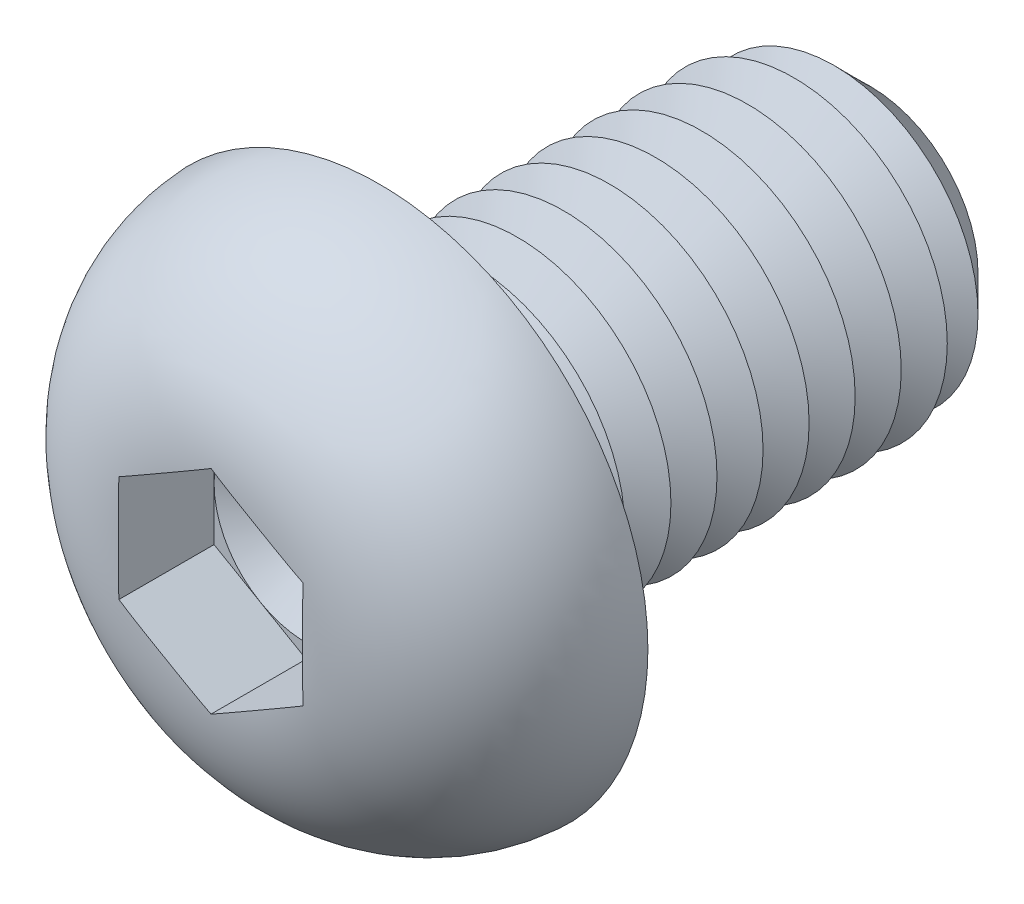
ISO-10303-21;
HEADER;
FILE_DESCRIPTION(('STEP AP214'),'2;1');
FILE_NAME('part.step','',(''),(''),'','','');
FILE_SCHEMA(('AUTOMOTIVE_DESIGN { 1 0 10303 214 1 1 1 1 }'));
ENDSEC;
DATA;
#1=APPLICATION_CONTEXT('core data for automotive mechanical design processes');
#2=APPLICATION_PROTOCOL_DEFINITION('international standard','automotive_design',2000,#1);
#3=PRODUCT_CONTEXT('',#1,'mechanical');
#4=PRODUCT('Part','Part','',(#3));
#5=PRODUCT_RELATED_PRODUCT_CATEGORY('part','',(#4));
#6=PRODUCT_DEFINITION_FORMATION('','',#4);
#7=PRODUCT_DEFINITION_CONTEXT('part definition',#1,'design');
#8=PRODUCT_DEFINITION('design','',#6,#7);
#9=PRODUCT_DEFINITION_SHAPE('','',#8);
#10=(LENGTH_UNIT() NAMED_UNIT(*) SI_UNIT(.MILLI.,.METRE.));
#11=(NAMED_UNIT(*) PLANE_ANGLE_UNIT() SI_UNIT($,.RADIAN.));
#12=(NAMED_UNIT(*) SI_UNIT($,.STERADIAN.) SOLID_ANGLE_UNIT());
#13=UNCERTAINTY_MEASURE_WITH_UNIT(LENGTH_MEASURE(1.E-05),#10,'distance_accuracy_value','');
#14=(GEOMETRIC_REPRESENTATION_CONTEXT(3) GLOBAL_UNCERTAINTY_ASSIGNED_CONTEXT((#13)) GLOBAL_UNIT_ASSIGNED_CONTEXT((#10,
#11,#12)) REPRESENTATION_CONTEXT('',''));
#15=CARTESIAN_POINT('',(0.,0.,0.));
#16=DIRECTION('',(0.,0.,1.));
#17=DIRECTION('',(1.,0.,0.));
#18=AXIS2_PLACEMENT_3D('',#15,#16,#17);
#19=CARTESIAN_POINT('',(0.,0.,2.38));
#20=DIRECTION('',(0.,0.,1.));
#21=DIRECTION('',(1.,0.,0.));
#22=AXIS2_PLACEMENT_3D('',#19,#20,#21);
#23=PLANE('',#22);
#24=CARTESIAN_POINT('',(0.,0.,2.38));
#25=DIRECTION('',(0.,0.,1.));
#26=DIRECTION('',(1.,0.,0.));
#27=AXIS2_PLACEMENT_3D('',#24,#25,#26);
#28=CIRCLE('',#27,3.);
#29=CARTESIAN_POINT('',(3.,0.,2.38));
#30=VERTEX_POINT('',#29);
#31=CARTESIAN_POINT('',(1.5,2.59807621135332,2.38));
#32=VERTEX_POINT('',#31);
#33=EDGE_CURVE('E117',#30,#32,#28,.T.);
#34=ORIENTED_EDGE('',*,*,#33,.F.);
#35=DIRECTION('',(0.,1.,0.));
#36=VECTOR('',#35,1.);
#37=CARTESIAN_POINT('',(3.,-1.73205080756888,2.38));
#38=LINE('',#37,#36);
#39=CARTESIAN_POINT('',(3.,1.73205080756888,2.38));
#40=VERTEX_POINT('',#39);
#41=EDGE_CURVE('E140',#30,#40,#38,.T.);
#42=ORIENTED_EDGE('',*,*,#41,.T.);
#43=DIRECTION('',(-0.866025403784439,0.5,0.));
#44=VECTOR('',#43,1.);
#45=CARTESIAN_POINT('',(3.,1.73205080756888,2.38));
#46=LINE('',#45,#44);
#47=EDGE_CURVE('E136',#40,#32,#46,.T.);
#48=ORIENTED_EDGE('',*,*,#47,.T.);
#49=EDGE_LOOP('',(#34,#42,#48));
#50=FACE_BOUND('',#49,.T.);
#51=ADVANCED_FACE('F39',(#50),#23,.T.);
#52=CARTESIAN_POINT('',(0.,0.,2.38));
#53=DIRECTION('',(0.,0.,1.));
#54=DIRECTION('',(1.,0.,0.));
#55=AXIS2_PLACEMENT_3D('',#52,#53,#54);
#56=CIRCLE('',#55,3.);
#57=CARTESIAN_POINT('',(-1.5,2.59807621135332,2.38));
#58=VERTEX_POINT('',#57);
#59=EDGE_CURVE('E11',#32,#58,#56,.T.);
#60=ORIENTED_EDGE('',*,*,#59,.F.);
#61=CARTESIAN_POINT('',(0.,3.46410161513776,2.38));
#62=VERTEX_POINT('',#61);
#63=EDGE_CURVE('E130',#32,#62,#46,.T.);
#64=ORIENTED_EDGE('',*,*,#63,.T.);
#65=DIRECTION('',(-0.866025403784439,-0.5,0.));
#66=VECTOR('',#65,1.);
#67=CARTESIAN_POINT('',(0.,3.46410161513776,2.38));
#68=LINE('',#67,#66);
#69=EDGE_CURVE('E131',#62,#58,#68,.T.);
#70=ORIENTED_EDGE('',*,*,#69,.T.);
#71=EDGE_LOOP('',(#60,#64,#70));
#72=FACE_BOUND('',#71,.T.);
#73=ADVANCED_FACE('F129',(#72),#23,.T.);
#74=CARTESIAN_POINT('',(-3.,0.,2.38));
#75=VERTEX_POINT('',#74);
#76=EDGE_CURVE('E49',#58,#75,#56,.T.);
#77=ORIENTED_EDGE('',*,*,#76,.F.);
#78=CARTESIAN_POINT('',(-3.,1.73205080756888,2.38));
#79=VERTEX_POINT('',#78);
#80=EDGE_CURVE('E143',#58,#79,#68,.T.);
#81=ORIENTED_EDGE('',*,*,#80,.T.);
#82=DIRECTION('',(0.,-1.,0.));
#83=VECTOR('',#82,1.);
#84=CARTESIAN_POINT('',(-3.,1.73205080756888,2.38));
#85=LINE('',#84,#83);
#86=EDGE_CURVE('E153',#79,#75,#85,.T.);
#87=ORIENTED_EDGE('',*,*,#86,.T.);
#88=EDGE_LOOP('',(#77,#81,#87));
#89=FACE_BOUND('',#88,.T.);
#90=ADVANCED_FACE('F275',(#89),#23,.T.);
#91=CARTESIAN_POINT('',(-1.5,-2.59807621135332,2.38));
#92=VERTEX_POINT('',#91);
#93=EDGE_CURVE('E260',#75,#92,#56,.T.);
#94=ORIENTED_EDGE('',*,*,#93,.F.);
#95=CARTESIAN_POINT('',(-3.,-1.73205080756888,2.38));
#96=VERTEX_POINT('',#95);
#97=EDGE_CURVE('E152',#75,#96,#85,.T.);
#98=ORIENTED_EDGE('',*,*,#97,.T.);
#99=DIRECTION('',(0.866025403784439,-0.5,0.));
#100=VECTOR('',#99,1.);
#101=CARTESIAN_POINT('',(-3.,-1.73205080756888,2.38));
#102=LINE('',#101,#100);
#103=EDGE_CURVE('E158',#96,#92,#102,.T.);
#104=ORIENTED_EDGE('',*,*,#103,.T.);
#105=EDGE_LOOP('',(#94,#98,#104));
#106=FACE_BOUND('',#105,.T.);
#107=ADVANCED_FACE('F269',(#106),#23,.T.);
#108=CARTESIAN_POINT('',(1.5,-2.59807621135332,2.38));
#109=VERTEX_POINT('',#108);
#110=EDGE_CURVE('E56',#92,#109,#56,.T.);
#111=ORIENTED_EDGE('',*,*,#110,.F.);
#112=CARTESIAN_POINT('',(0.,-3.46410161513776,2.38));
#113=VERTEX_POINT('',#112);
#114=EDGE_CURVE('E157',#92,#113,#102,.T.);
#115=ORIENTED_EDGE('',*,*,#114,.T.);
#116=DIRECTION('',(0.866025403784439,0.5,0.));
#117=VECTOR('',#116,1.);
#118=CARTESIAN_POINT('',(0.,-3.46410161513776,2.38));
#119=LINE('',#118,#117);
#120=EDGE_CURVE('E163',#113,#109,#119,.T.);
#121=ORIENTED_EDGE('',*,*,#120,.T.);
#122=EDGE_LOOP('',(#111,#115,#121));
#123=FACE_BOUND('',#122,.T.);
#124=ADVANCED_FACE('F311',(#123),#23,.T.);
#125=CARTESIAN_POINT('',(0.,0.,-16.));
#126=DIRECTION('',(0.,0.,1.));
#127=DIRECTION('',(1.,0.,0.));
#128=AXIS2_PLACEMENT_3D('',#125,#126,#127);
#129=CYLINDRICAL_SURFACE('',#128,5.);
#130=CARTESIAN_POINT('',(0.,0.,-0.6));
#131=DIRECTION('',(0.,0.,1.));
#132=DIRECTION('',(1.,0.,0.));
#133=AXIS2_PLACEMENT_3D('',#130,#131,#132);
#134=CIRCLE('',#133,5.);
#135=CARTESIAN_POINT('',(5.,0.,-0.6));
#136=VERTEX_POINT('',#135);
#137=EDGE_CURVE('E242',#136,#136,#134,.F.);
#138=ORIENTED_EDGE('',*,*,#137,.T.);
#139=EDGE_LOOP('',(#138));
#140=FACE_BOUND('',#139,.T.);
#141=CARTESIAN_POINT('',(0.,0.,-1.5));
#142=DIRECTION('',(0.,0.,1.));
#143=DIRECTION('',(1.,0.,0.));
#144=AXIS2_PLACEMENT_3D('',#141,#142,#143);
#145=CIRCLE('',#144,5.00000000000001);
#146=CARTESIAN_POINT('',(5.00000000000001,0.,-1.5));
#147=VERTEX_POINT('',#146);
#148=EDGE_CURVE('E138',#147,#147,#145,.T.);
#149=ORIENTED_EDGE('',*,*,#148,.T.);
#150=EDGE_LOOP('',(#149));
#151=FACE_BOUND('',#150,.T.);
#152=ADVANCED_FACE('F312',(#140,#151),#129,.T.);
#153=CARTESIAN_POINT('',(0.,8.75,0.));
#154=DIRECTION('',(0.,0.,1.));
#155=DIRECTION('',(1.,0.,0.));
#156=AXIS2_PLACEMENT_3D('',#153,#154,#155);
#157=PLANE('',#156);
#158=CARTESIAN_POINT('',(0.,0.,0.));
#159=DIRECTION('',(0.,0.,1.));
#160=DIRECTION('',(1.,0.,0.));
#161=AXIS2_PLACEMENT_3D('',#158,#159,#160);
#162=CIRCLE('',#161,5.6);
#163=CARTESIAN_POINT('',(5.6,0.,0.));
#164=VERTEX_POINT('',#163);
#165=EDGE_CURVE('E251',#164,#164,#162,.T.);
#166=ORIENTED_EDGE('',*,*,#165,.T.);
#167=EDGE_LOOP('',(#166));
#168=FACE_BOUND('',#167,.T.);
#169=CARTESIAN_POINT('',(0.,0.,0.));
#170=DIRECTION('',(0.,0.,1.));
#171=DIRECTION('',(1.,0.,0.));
#172=AXIS2_PLACEMENT_3D('',#169,#170,#171);
#173=CIRCLE('',#172,8.75);
#174=CARTESIAN_POINT('',(8.75,0.,0.));
#175=VERTEX_POINT('',#174);
#176=EDGE_CURVE('E174',#175,#175,#173,.T.);
#177=ORIENTED_EDGE('',*,*,#176,.F.);
#178=EDGE_LOOP('',(#177));
#179=FACE_BOUND('',#178,.T.);
#180=ADVANCED_FACE('F315',(#168,#179),#157,.F.);
#181=CARTESIAN_POINT('',(0.,0.,-0.3));
#182=DIRECTION('',(0.,0.,1.));
#183=DIRECTION('',(1.,0.,0.));
#184=AXIS2_PLACEMENT_3D('',#181,#182,#183);
#185=DEGENERATE_TOROIDAL_SURFACE('',#184,2.95776381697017,5.8,.T.);
#186=CARTESIAN_POINT('',(-3.0002,1.73193533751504,5.47784605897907));
#187=CARTESIAN_POINT('',(-2.87524340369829,1.80407906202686,5.4841525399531));
#188=CARTESIAN_POINT('',(-2.75023731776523,1.87625135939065,5.48853670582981));
#189=CARTESIAN_POINT('',(-2.5001955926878,2.02061301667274,5.49472046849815));
#190=CARTESIAN_POINT('',(-2.37515996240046,2.09280237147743,5.49652051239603));
#191=CARTESIAN_POINT('',(-2.12510741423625,2.23717027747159,5.4987972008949));
#192=CARTESIAN_POINT('',(-2.00009049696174,2.30934882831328,5.49927407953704));
#193=CARTESIAN_POINT('',(-1.75004905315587,2.45371032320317,5.49979859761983));
#194=CARTESIAN_POINT('',(-1.62502452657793,2.52589326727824,5.49984621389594));
#195=CARTESIAN_POINT('',(-1.37497547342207,2.67025915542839,5.49984621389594));
#196=CARTESIAN_POINT('',(-1.24995094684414,2.74244209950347,5.49979859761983));
#197=CARTESIAN_POINT('',(-0.999909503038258,2.88680359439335,5.49927407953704));
#198=CARTESIAN_POINT('',(-0.874892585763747,2.95898214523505,5.4987972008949));
#199=CARTESIAN_POINT('',(-0.624840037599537,3.10335005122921,5.49652051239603));
#200=CARTESIAN_POINT('',(-0.499804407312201,3.1755394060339,5.49472046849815));
#201=CARTESIAN_POINT('',(-0.249762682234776,3.31990106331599,5.48853670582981));
#202=CARTESIAN_POINT('',(-0.124756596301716,3.39207336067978,5.4841525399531));
#203=CARTESIAN_POINT('',(0.000199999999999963,3.46421708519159,5.47784605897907));
#204=B_SPLINE_CURVE_WITH_KNOTS('',3,(#186,#187,#188,#189,#190,#191,#192,#193,#194,#195,#196,
#197,#198,#199,#200,#201,#202,#203),.UNSPECIFIED.,.F.,.F.,(4,2,2,2,2,2,2,2,4),(0.,
0.433225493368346,0.866376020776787,1.29944992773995,1.73254720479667,2.16564448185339,
2.59871838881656,3.031868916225,3.46509440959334),.UNSPECIFIED.);
#205=CARTESIAN_POINT('',(-3.,1.73205080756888,5.4778561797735));
#206=VERTEX_POINT('',#205);
#207=CARTESIAN_POINT('',(0.,3.46410161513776,5.4778561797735));
#208=VERTEX_POINT('',#207);
#209=EDGE_CURVE('E196',#206,#208,#204,.T.);
#210=ORIENTED_EDGE('',*,*,#209,.T.);
#211=CARTESIAN_POINT('',(-0.000200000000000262,3.46421708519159,5.47784605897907));
#212=CARTESIAN_POINT('',(0.124756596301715,3.39207336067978,5.4841525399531));
#213=CARTESIAN_POINT('',(0.249762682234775,3.31990106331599,5.48853670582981));
#214=CARTESIAN_POINT('',(0.4998044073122,3.1755394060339,5.49472046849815));
#215=CARTESIAN_POINT('',(0.624840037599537,3.10335005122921,5.49652051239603));
#216=CARTESIAN_POINT('',(0.874892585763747,2.95898214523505,5.4987972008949));
#217=CARTESIAN_POINT('',(0.999909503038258,2.88680359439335,5.49927407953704));
#218=CARTESIAN_POINT('',(1.24995094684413,2.74244209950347,5.49979859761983));
#219=CARTESIAN_POINT('',(1.37497547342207,2.67025915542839,5.49984621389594));
#220=CARTESIAN_POINT('',(1.62502452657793,2.52589326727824,5.49984621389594));
#221=CARTESIAN_POINT('',(1.75004905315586,2.45371032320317,5.49979859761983));
#222=CARTESIAN_POINT('',(2.00009049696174,2.30934882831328,5.49927407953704));
#223=CARTESIAN_POINT('',(2.12510741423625,2.23717027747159,5.4987972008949));
#224=CARTESIAN_POINT('',(2.37515996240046,2.09280237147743,5.49652051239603));
#225=CARTESIAN_POINT('',(2.5001955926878,2.02061301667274,5.49472046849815));
#226=CARTESIAN_POINT('',(2.75023731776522,1.87625135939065,5.48853670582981));
#227=CARTESIAN_POINT('',(2.87524340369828,1.80407906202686,5.4841525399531));
#228=CARTESIAN_POINT('',(3.0002,1.73193533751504,5.47784605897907));
#229=B_SPLINE_CURVE_WITH_KNOTS('',3,(#211,#212,#213,#214,#215,#216,#217,#218,#219,#220,#221,
#222,#223,#224,#225,#226,#227,#228),.UNSPECIFIED.,.F.,.F.,(4,2,2,2,2,2,2,2,4),(0.,
0.433225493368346,0.866376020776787,1.29944992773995,1.73254720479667,2.16564448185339,
2.59871838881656,3.031868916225,3.46509440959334),.UNSPECIFIED.);
#230=CARTESIAN_POINT('',(3.,1.73205080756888,5.47785617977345));
#231=VERTEX_POINT('',#230);
#232=EDGE_CURVE('E225',#208,#231,#229,.T.);
#233=ORIENTED_EDGE('',*,*,#232,.T.);
#234=CARTESIAN_POINT('',(3.,0.,5.49984621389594));
#235=CARTESIAN_POINT('',(3.,-0.125570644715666,5.49984449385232));
#236=CARTESIAN_POINT('',(3.,-0.251141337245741,5.49980426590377));
#237=CARTESIAN_POINT('',(3.,-0.502283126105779,5.499449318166));
#238=CARTESIAN_POINT('',(3.,-0.62785422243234,5.49913459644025));
#239=CARTESIAN_POINT('',(3.,-0.879037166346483,5.49770394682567));
#240=CARTESIAN_POINT('',(3.,-1.00464901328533,5.49658774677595));
#241=CARTESIAN_POINT('',(3.,-1.2558477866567,5.49279605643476));
#242=CARTESIAN_POINT('',(3.,-1.38143471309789,5.49012056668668));
#243=CARTESIAN_POINT('',(3.,-1.7568847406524,5.47847778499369));
#244=CARTESIAN_POINT('',(3.,-2.00667103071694,5.46590367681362));
#245=CARTESIAN_POINT('',(3.,-2.50488375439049,5.42441448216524));
#246=CARTESIAN_POINT('',(3.,-2.75331093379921,5.3955095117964));
#247=CARTESIAN_POINT('',(3.,-3.18719021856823,5.32582626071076));
#248=CARTESIAN_POINT('',(3.,-3.3733635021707,5.28960049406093));
#249=CARTESIAN_POINT('',(3.,-3.74245496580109,5.20330651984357));
#250=CARTESIAN_POINT('',(3.,-3.92537417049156,5.15324275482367));
#251=CARTESIAN_POINT('',(3.,-4.28675502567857,5.03819885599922));
#252=CARTESIAN_POINT('',(3.,-4.46521058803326,4.97319946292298));
#253=CARTESIAN_POINT('',(3.,-4.81576789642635,4.82782766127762));
#254=CARTESIAN_POINT('',(3.,-4.98786985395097,4.74745576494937));
#255=CARTESIAN_POINT('',(3.,-5.3254008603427,4.5705398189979));
#256=CARTESIAN_POINT('',(3.,-5.49076268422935,4.47386710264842));
#257=CARTESIAN_POINT('',(3.,-5.81151175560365,4.26514040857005));
#258=CARTESIAN_POINT('',(3.,-5.96689840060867,4.15308550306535));
#259=CARTESIAN_POINT('',(3.,-6.26591787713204,3.91428862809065));
#260=CARTESIAN_POINT('',(3.,-6.40955257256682,3.78754899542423));
#261=CARTESIAN_POINT('',(3.,-6.68342295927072,3.52034797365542));
#262=CARTESIAN_POINT('',(3.,-6.81366070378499,3.3798886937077));
#263=CARTESIAN_POINT('',(3.,-7.0426666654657,3.10626157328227));
#264=CARTESIAN_POINT('',(3.,-7.1433109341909,2.97465879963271));
#265=CARTESIAN_POINT('',(3.,-7.33253056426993,2.70304716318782));
#266=CARTESIAN_POINT('',(3.,-7.42110686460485,2.56303895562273));
#267=CARTESIAN_POINT('',(3.,-7.58534868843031,2.27573732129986));
#268=CARTESIAN_POINT('',(3.,-7.66102067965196,2.12844759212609));
#269=CARTESIAN_POINT('',(3.,-7.79881901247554,1.82765987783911));
#270=CARTESIAN_POINT('',(3.,-7.86094563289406,1.67416202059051));
#271=CARTESIAN_POINT('',(3.,-7.96803488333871,1.37082076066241));
#272=CARTESIAN_POINT('',(3.,-8.01375687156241,1.22124490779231));
#273=CARTESIAN_POINT('',(3.,-8.09224398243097,0.918674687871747));
#274=CARTESIAN_POINT('',(3.,-8.12500479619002,0.765679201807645));
#275=CARTESIAN_POINT('',(3.,-8.17726457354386,0.457507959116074));
#276=CARTESIAN_POINT('',(3.,-8.1967692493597,0.302333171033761));
#277=CARTESIAN_POINT('',(3.,-8.22238322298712,-0.00917738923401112));
#278=CARTESIAN_POINT('',(3.,-8.22848754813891,-0.165513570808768));
#279=CARTESIAN_POINT('',(3.,-8.22724693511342,-0.475358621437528));
#280=CARTESIAN_POINT('',(3.,-8.2201384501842,-0.628868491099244));
#281=CARTESIAN_POINT('',(3.,-8.1929851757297,-0.934809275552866));
#282=CARTESIAN_POINT('',(3.,-8.17293462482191,-1.0872396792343));
#283=CARTESIAN_POINT('',(3.,-8.1200547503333,-1.38984943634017));
#284=CARTESIAN_POINT('',(3.,-8.08722683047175,-1.54002903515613));
#285=CARTESIAN_POINT('',(3.,-8.0090712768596,-1.83702738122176));
#286=CARTESIAN_POINT('',(3.,-7.96374919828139,-1.98384759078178));
#287=CARTESIAN_POINT('',(3.,-7.86096457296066,-2.27315566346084));
#288=CARTESIAN_POINT('',(3.,-7.80350334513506,-2.41564399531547));
#289=CARTESIAN_POINT('',(3.,-7.67691451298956,-2.6952770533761));
#290=CARTESIAN_POINT('',(3.,-7.60779108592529,-2.83242367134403));
#291=CARTESIAN_POINT('',(3.,-7.45837210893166,-3.10056990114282));
#292=CARTESIAN_POINT('',(3.,-7.37807144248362,-3.23156666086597));
#293=CARTESIAN_POINT('',(3.,-7.20697634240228,-3.48645411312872));
#294=CARTESIAN_POINT('',(3.,-7.11618520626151,-3.61034702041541));
#295=CARTESIAN_POINT('',(3.,-6.92334779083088,-3.85210954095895));
#296=CARTESIAN_POINT('',(3.,-6.82115263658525,-3.96986038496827));
#297=CARTESIAN_POINT('',(3.,-6.60745266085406,-4.19658717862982));
#298=CARTESIAN_POINT('',(3.,-6.49594754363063,-4.30556284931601));
#299=CARTESIAN_POINT('',(3.,-6.26450055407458,-4.51413072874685));
#300=CARTESIAN_POINT('',(3.,-6.14455919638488,-4.61372350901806));
#301=CARTESIAN_POINT('',(3.,-5.8971402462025,-4.80306090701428));
#302=CARTESIAN_POINT('',(3.,-5.76966228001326,-4.89280503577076));
#303=CARTESIAN_POINT('',(3.,-5.50268934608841,-5.06561354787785));
#304=CARTESIAN_POINT('',(3.,-5.36291526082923,-5.14824654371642));
#305=CARTESIAN_POINT('',(3.,-5.07726499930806,-5.30226841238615));
#306=CARTESIAN_POINT('',(3.,-4.93138704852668,-5.37365398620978));
#307=CARTESIAN_POINT('',(3.,-4.63484455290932,-5.50505544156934));
#308=CARTESIAN_POINT('',(3.,-4.48418671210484,-5.56508649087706));
#309=CARTESIAN_POINT('',(3.,-4.17906596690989,-5.6740700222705));
#310=CARTESIAN_POINT('',(3.,-4.02460600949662,-5.72303080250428));
#311=CARTESIAN_POINT('',(3.,-3.6739247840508,-5.82125760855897));
#312=CARTESIAN_POINT('',(3.,-3.47687521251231,-5.86756841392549));
#313=CARTESIAN_POINT('',(3.,-3.07981530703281,-5.94521593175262));
#314=CARTESIAN_POINT('',(3.,-2.87980357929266,-5.97654534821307));
#315=CARTESIAN_POINT('',(3.,-2.47751859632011,-6.02656554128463));
#316=CARTESIAN_POINT('',(3.,-2.27523974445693,-6.0452096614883));
#317=CARTESIAN_POINT('',(3.,-1.8700786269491,-6.07274849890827));
#318=CARTESIAN_POINT('',(3.,-1.66719636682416,-6.08164330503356));
#319=CARTESIAN_POINT('',(3.,-1.25887867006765,-6.09343726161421));
#320=CARTESIAN_POINT('',(3.,-1.05344157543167,-6.09626381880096));
#321=CARTESIAN_POINT('',(3.,-0.745285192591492,-6.0985660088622));
#322=CARTESIAN_POINT('',(3.,-0.642567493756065,-6.09901047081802));
#323=CARTESIAN_POINT('',(3.,-0.437131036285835,-6.09957976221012));
#324=CARTESIAN_POINT('',(3.,-0.334412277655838,-6.09970459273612));
#325=CARTESIAN_POINT('',(3.,-0.129132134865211,-6.09984385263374));
#326=CARTESIAN_POINT('',(3.,-0.0265707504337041,-6.09985845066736));
#327=CARTESIAN_POINT('',(3.,0.178552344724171,-6.09981980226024));
#328=CARTESIAN_POINT('',(3.,0.281114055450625,-6.09976655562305));
#329=CARTESIAN_POINT('',(3.,0.486235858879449,-6.09946703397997));
#330=CARTESIAN_POINT('',(3.,0.588795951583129,-6.0992207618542));
#331=CARTESIAN_POINT('',(3.,0.793913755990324,-6.09826017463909));
#332=CARTESIAN_POINT('',(3.,0.896471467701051,-6.097545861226));
#333=CARTESIAN_POINT('',(3.,1.11088851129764,-6.0951586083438));
#334=CARTESIAN_POINT('',(3.,1.22274716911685,-6.0934045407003));
#335=CARTESIAN_POINT('',(3.,1.44642575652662,-6.08829151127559));
#336=CARTESIAN_POINT('',(3.,1.55824568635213,-6.08493255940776));
#337=CARTESIAN_POINT('',(3.,1.89360474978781,-6.07150074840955));
#338=CARTESIAN_POINT('',(3.,2.11703989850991,-6.05807293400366));
#339=CARTESIAN_POINT('',(3.,2.56083256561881,-6.01778675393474));
#340=CARTESIAN_POINT('',(3.,2.78120000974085,-5.99104517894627));
#341=CARTESIAN_POINT('',(3.,3.2192866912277,-5.92065658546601));
#342=CARTESIAN_POINT('',(3.,3.43700630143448,-5.8770119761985));
#343=CARTESIAN_POINT('',(3.,3.82666678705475,-5.78060449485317));
#344=CARTESIAN_POINT('',(3.,3.99942726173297,-5.73116262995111));
#345=CARTESIAN_POINT('',(3.,4.3405567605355,-5.61888897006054));
#346=CARTESIAN_POINT('',(3.,4.50892617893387,-5.55605838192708));
#347=CARTESIAN_POINT('',(3.,4.84049143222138,-5.41635874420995));
#348=CARTESIAN_POINT('',(3.,5.00366586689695,-5.33943871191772));
#349=CARTESIAN_POINT('',(3.,5.32271829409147,-5.17167128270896));
#350=CARTESIAN_POINT('',(3.,5.47859600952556,-5.0808233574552));
#351=CARTESIAN_POINT('',(3.,5.7822829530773,-4.88500135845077));
#352=CARTESIAN_POINT('',(3.,5.93005015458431,-4.77996197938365));
#353=CARTESIAN_POINT('',(3.,6.21523046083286,-4.55663689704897));
#354=CARTESIAN_POINT('',(3.,6.35264336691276,-4.43835093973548));
#355=CARTESIAN_POINT('',(3.,6.61552762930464,-4.18948618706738));
#356=CARTESIAN_POINT('',(3.,6.74101380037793,-4.05892305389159));
#357=CARTESIAN_POINT('',(3.,6.97891308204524,-3.78639059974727));
#358=CARTESIAN_POINT('',(3.,7.09132750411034,-3.64442242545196));
#359=CARTESIAN_POINT('',(3.,7.29113623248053,-3.36530209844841));
#360=CARTESIAN_POINT('',(3.,7.37991316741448,-3.22913733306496));
#361=CARTESIAN_POINT('',(3.,7.5451968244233,-2.94955428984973));
#362=CARTESIAN_POINT('',(3.,7.62170419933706,-2.80613639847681));
#363=CARTESIAN_POINT('',(3.,7.76177641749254,-2.5131168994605));
#364=CARTESIAN_POINT('',(3.,7.82534152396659,-2.36351541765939));
#365=CARTESIAN_POINT('',(3.,7.93897019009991,-2.05926799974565));
#366=CARTESIAN_POINT('',(3.,7.98903395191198,-1.9046221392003));
#367=CARTESIAN_POINT('',(3.,8.07336540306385,-1.59821781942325));
#368=CARTESIAN_POINT('',(3.,8.10821878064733,-1.44662026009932));
#369=CARTESIAN_POINT('',(3.,8.16487862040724,-1.14095089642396));
#370=CARTESIAN_POINT('',(3.,8.18668070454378,-0.986878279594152));
#371=CARTESIAN_POINT('',(3.,8.21703234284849,-0.677515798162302));
#372=CARTESIAN_POINT('',(3.,8.22558889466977,-0.522226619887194));
#373=CARTESIAN_POINT('',(3.,8.22940229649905,-0.211427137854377));
#374=CARTESIAN_POINT('',(3.,8.22465425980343,-0.0559167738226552));
#375=CARTESIAN_POINT('',(3.,8.20204101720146,0.252033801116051));
#376=CARTESIAN_POINT('',(3.,8.18435378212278,0.404487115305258));
#377=CARTESIAN_POINT('',(3.,8.136196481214,0.707418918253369));
#378=CARTESIAN_POINT('',(3.,8.1057217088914,0.857896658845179));
#379=CARTESIAN_POINT('',(3.,8.03224632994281,1.15569567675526));
#380=CARTESIAN_POINT('',(3.,7.9892508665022,1.30301822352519));
#381=CARTESIAN_POINT('',(3.,7.89104818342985,1.59360769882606));
#382=CARTESIAN_POINT('',(3.,7.83583549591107,1.73687277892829));
#383=CARTESIAN_POINT('',(3.,7.71349498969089,2.01864020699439));
#384=CARTESIAN_POINT('',(3.,7.64633814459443,2.1571299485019));
#385=CARTESIAN_POINT('',(3.,7.50076383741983,2.42797950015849));
#386=CARTESIAN_POINT('',(3.,7.42235122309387,2.56034191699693));
#387=CARTESIAN_POINT('',(3.,7.25483284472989,2.8181715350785));
#388=CARTESIAN_POINT('',(3.,7.16572386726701,2.94363664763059));
#389=CARTESIAN_POINT('',(3.,6.9775559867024,3.1867979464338));
#390=CARTESIAN_POINT('',(3.,6.87850037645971,3.30449668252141));
#391=CARTESIAN_POINT('',(3.,6.66919743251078,3.53363644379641));
#392=CARTESIAN_POINT('',(3.,6.55877281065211,3.6449154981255));
#393=CARTESIAN_POINT('',(3.,6.32925753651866,3.85806320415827));
#394=CARTESIAN_POINT('',(3.,6.21016952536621,3.95993470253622));
#395=CARTESIAN_POINT('',(3.,5.96413069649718,4.15386505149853));
#396=CARTESIAN_POINT('',(3.,5.83717459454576,4.24591719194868));
#397=CARTESIAN_POINT('',(3.,5.5764653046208,4.41973423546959));
#398=CARTESIAN_POINT('',(3.,5.4427139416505,4.50150188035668));
#399=CARTESIAN_POINT('',(3.,5.16249709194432,4.65840017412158));
#400=CARTESIAN_POINT('',(3.,5.01573037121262,4.73299250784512));
#401=CARTESIAN_POINT('',(3.,4.71685583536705,4.87057528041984));
#402=CARTESIAN_POINT('',(3.,4.56474751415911,4.93356461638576));
#403=CARTESIAN_POINT('',(3.,4.25657035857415,5.04801407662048));
#404=CARTESIAN_POINT('',(3.,4.10050882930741,5.09949395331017));
#405=CARTESIAN_POINT('',(3.,3.78523286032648,5.19149003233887));
#406=CARTESIAN_POINT('',(3.,3.62601895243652,5.23200806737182));
#407=CARTESIAN_POINT('',(3.,3.32461902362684,5.29856444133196));
#408=CARTESIAN_POINT('',(3.,3.18268434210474,5.32575733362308));
#409=CARTESIAN_POINT('',(3.,2.89760844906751,5.3729307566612));
#410=CARTESIAN_POINT('',(3.,2.75446703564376,5.39291005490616));
#411=CARTESIAN_POINT('',(3.,2.46730946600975,5.42656527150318));
#412=CARTESIAN_POINT('',(3.,2.32329255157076,5.44023457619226));
#413=CARTESIAN_POINT('',(3.,2.03487642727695,5.46234228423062));
#414=CARTESIAN_POINT('',(3.,1.89047722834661,5.4707808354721));
#415=CARTESIAN_POINT('',(3.,1.60058090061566,5.48373897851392));
#416=CARTESIAN_POINT('',(3.,1.45508270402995,5.48823290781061));
#417=CARTESIAN_POINT('',(3.,1.16402671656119,5.49458098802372));
#418=CARTESIAN_POINT('',(3.,1.01846892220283,5.49643495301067));
#419=CARTESIAN_POINT('',(3.,0.72742451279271,5.49877506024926));
#420=CARTESIAN_POINT('',(3.,0.581937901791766,5.49926194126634));
#421=CARTESIAN_POINT('',(3.,0.290967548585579,5.49979850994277));
#422=CARTESIAN_POINT('',(3.,0.145483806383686,5.49984820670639));
#423=CARTESIAN_POINT('',(3.,0.,5.49984621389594));
#424=B_SPLINE_CURVE_WITH_KNOTS('',3,(#234,#235,#236,#237,#238,#239,#240,#241,#242,#243,#244,
#245,#246,#247,#248,#249,#250,#251,#252,#253,#254,#255,#256,#257,#258,#259,#260,#261,#262,#263,
#264,#265,#266,#267,#268,#269,#270,#271,#272,#273,#274,#275,#276,#277,#278,#279,#280,#281,#282,
#283,#284,#285,#286,#287,#288,#289,#290,#291,#292,#293,#294,#295,#296,#297,#298,#299,#300,#301,
#302,#303,#304,#305,#306,#307,#308,#309,#310,#311,#312,#313,#314,#315,#316,#317,#318,#319,#320,
#321,#322,#323,#324,#325,#326,#327,#328,#329,#330,#331,#332,#333,#334,#335,#336,#337,#338,#339,
#340,#341,#342,#343,#344,#345,#346,#347,#348,#349,#350,#351,#352,#353,#354,#355,#356,#357,#358,
#359,#360,#361,#362,#363,#364,#365,#366,#367,#368,#369,#370,#371,#372,#373,#374,#375,#376,#377,
#378,#379,#380,#381,#382,#383,#384,#385,#386,#387,#388,#389,#390,#391,#392,#393,#394,#395,#396,
#397,#398,#399,#400,#401,#402,#403,#404,#405,#406,#407,#408,#409,#410,#411,#412,#413,#414,#415,
#416,#417,#418,#419,#420,#421,#422,#423),.UNSPECIFIED.,.T.,.F.,(4,2,2,2,2,2,2,2,2,2,2,2,2,2,2,2,
2,2,2,2,2,2,2,2,2,2,2,2,2,2,2,2,2,2,2,2,2,2,2,2,2,2,2,2,2,2,2,2,2,2,2,2,2,2,2,2,2,2,2,2,2,2,2,2,
2,2,2,2,2,2,2,2,2,2,2,2,2,2,2,2,2,2,2,2,2,2,2,2,2,2,2,2,2,2,4),(0.,0.376711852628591,
0.753426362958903,1.13026885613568,1.50711121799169,2.257095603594,3.00661592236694,
3.57514719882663,4.14349616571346,4.71258216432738,5.28164920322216,5.85543852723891,
6.42926247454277,7.00299523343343,7.57663992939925,8.07303876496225,8.56939895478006,
9.06550962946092,9.56161009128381,10.030267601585,10.4990807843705,10.9676918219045,
11.4364767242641,11.8969530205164,12.3576344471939,12.8182652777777,13.2786916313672,
13.7390679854,14.1992797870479,14.6597029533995,15.1199817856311,15.5871904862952,
16.0544140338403,16.5216091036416,16.9888273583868,17.4754224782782,17.9621600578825,
18.4482427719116,18.9339599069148,19.5405320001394,20.1473991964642,20.7564865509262,
21.3655683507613,21.9818967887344,22.2900536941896,22.5982095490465,22.905893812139,
23.2135789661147,23.5212595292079,23.8289389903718,24.1645461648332,24.5001512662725,
25.171371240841,25.8368042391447,26.5021424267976,27.0407309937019,27.5792710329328,
28.119799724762,28.660348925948,29.2034761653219,29.7466138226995,30.2890677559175,
30.831467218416,31.3185063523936,31.8055195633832,32.2925228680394,32.779518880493,
33.2456153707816,33.7118681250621,34.1778744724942,34.6440520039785,35.103935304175,
35.563988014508,36.0238520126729,36.4839222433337,36.9451261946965,37.4061321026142,
37.8672768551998,38.3282694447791,38.7980460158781,39.2676799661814,39.7376328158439,
40.207460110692,40.7008436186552,41.1942739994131,41.6868509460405,42.1793454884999,
42.6126940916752,43.0461167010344,43.479992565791,43.9138561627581,44.3505218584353,
44.7872183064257,45.2236787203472,45.6601300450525),.UNSPECIFIED.);
#425=CARTESIAN_POINT('',(3.,-1.73205080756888,5.4778561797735));
#426=VERTEX_POINT('',#425);
#427=EDGE_CURVE('E234',#231,#426,#424,.T.);
#428=ORIENTED_EDGE('',*,*,#427,.T.);
#429=CARTESIAN_POINT('',(3.0002,-1.73193533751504,5.47784605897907));
#430=CARTESIAN_POINT('',(2.87524340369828,-1.80407906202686,5.4841525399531));
#431=CARTESIAN_POINT('',(2.75023731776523,-1.87625135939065,5.48853670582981));
#432=CARTESIAN_POINT('',(2.5001955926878,-2.02061301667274,5.49472046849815));
#433=CARTESIAN_POINT('',(2.37515996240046,-2.09280237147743,5.49652051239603));
#434=CARTESIAN_POINT('',(2.12510741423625,-2.23717027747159,5.4987972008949));
#435=CARTESIAN_POINT('',(2.00009049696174,-2.30934882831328,5.49927407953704));
#436=CARTESIAN_POINT('',(1.75004905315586,-2.45371032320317,5.49979859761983));
#437=CARTESIAN_POINT('',(1.62502452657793,-2.52589326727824,5.49984621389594));
#438=CARTESIAN_POINT('',(1.37497547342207,-2.67025915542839,5.49984621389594));
#439=CARTESIAN_POINT('',(1.24995094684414,-2.74244209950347,5.49979859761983));
#440=CARTESIAN_POINT('',(0.999909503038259,-2.88680359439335,5.49927407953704));
#441=CARTESIAN_POINT('',(0.874892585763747,-2.95898214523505,5.4987972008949));
#442=CARTESIAN_POINT('',(0.624840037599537,-3.10335005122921,5.49652051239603));
#443=CARTESIAN_POINT('',(0.499804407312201,-3.1755394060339,5.49472046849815));
#444=CARTESIAN_POINT('',(0.249762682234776,-3.31990106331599,5.48853670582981));
#445=CARTESIAN_POINT('',(0.124756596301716,-3.39207336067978,5.4841525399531));
#446=CARTESIAN_POINT('',(-0.000199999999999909,-3.46421708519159,5.47784605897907));
#447=B_SPLINE_CURVE_WITH_KNOTS('',3,(#429,#430,#431,#432,#433,#434,#435,#436,#437,#438,#439,
#440,#441,#442,#443,#444,#445,#446),.UNSPECIFIED.,.F.,.F.,(4,2,2,2,2,2,2,2,4),(0.,
0.433225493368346,0.866376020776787,1.29944992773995,1.73254720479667,2.16564448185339,
2.59871838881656,3.031868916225,3.46509440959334),.UNSPECIFIED.);
#448=CARTESIAN_POINT('',(0.,-3.46410161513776,5.4778561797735));
#449=VERTEX_POINT('',#448);
#450=EDGE_CURVE('E285',#426,#449,#447,.T.);
#451=ORIENTED_EDGE('',*,*,#450,.T.);
#452=CARTESIAN_POINT('',(0.000200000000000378,-3.46421708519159,5.47784605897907));
#453=CARTESIAN_POINT('',(-0.124756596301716,-3.39207336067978,5.4841525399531));
#454=CARTESIAN_POINT('',(-0.249762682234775,-3.31990106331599,5.48853670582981));
#455=CARTESIAN_POINT('',(-0.499804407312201,-3.1755394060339,5.49472046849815));
#456=CARTESIAN_POINT('',(-0.624840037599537,-3.10335005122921,5.49652051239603));
#457=CARTESIAN_POINT('',(-0.874892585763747,-2.95898214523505,5.4987972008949));
#458=CARTESIAN_POINT('',(-0.999909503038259,-2.88680359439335,5.49927407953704));
#459=CARTESIAN_POINT('',(-1.24995094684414,-2.74244209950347,5.49979859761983));
#460=CARTESIAN_POINT('',(-1.37497547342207,-2.67025915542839,5.49984621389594));
#461=CARTESIAN_POINT('',(-1.62502452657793,-2.52589326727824,5.49984621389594));
#462=CARTESIAN_POINT('',(-1.75004905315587,-2.45371032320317,5.49979859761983));
#463=CARTESIAN_POINT('',(-2.00009049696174,-2.30934882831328,5.49927407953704));
#464=CARTESIAN_POINT('',(-2.12510741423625,-2.23717027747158,5.4987972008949));
#465=CARTESIAN_POINT('',(-2.37515996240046,-2.09280237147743,5.49652051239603));
#466=CARTESIAN_POINT('',(-2.5001955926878,-2.02061301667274,5.49472046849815));
#467=CARTESIAN_POINT('',(-2.75023731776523,-1.87625135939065,5.48853670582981));
#468=CARTESIAN_POINT('',(-2.87524340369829,-1.80407906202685,5.4841525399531));
#469=CARTESIAN_POINT('',(-3.0002,-1.73193533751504,5.47784605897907));
#470=B_SPLINE_CURVE_WITH_KNOTS('',3,(#452,#453,#454,#455,#456,#457,#458,#459,#460,#461,#462,
#463,#464,#465,#466,#467,#468,#469),.UNSPECIFIED.,.F.,.F.,(4,2,2,2,2,2,2,2,4),(0.,
0.433225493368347,0.866376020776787,1.29944992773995,1.73254720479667,2.16564448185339,
2.59871838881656,3.031868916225,3.46509440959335),.UNSPECIFIED.);
#471=CARTESIAN_POINT('',(-3.,-1.73205080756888,5.47785617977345));
#472=VERTEX_POINT('',#471);
#473=EDGE_CURVE('E282',#449,#472,#470,.T.);
#474=ORIENTED_EDGE('',*,*,#473,.T.);
#475=CARTESIAN_POINT('',(-3.,0.,5.49984621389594));
#476=CARTESIAN_POINT('',(-3.,0.125570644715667,5.49984449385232));
#477=CARTESIAN_POINT('',(-3.,0.251141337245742,5.49980426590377));
#478=CARTESIAN_POINT('',(-3.,0.50228312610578,5.499449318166));
#479=CARTESIAN_POINT('',(-3.,0.627854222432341,5.49913459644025));
#480=CARTESIAN_POINT('',(-3.,0.879037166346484,5.49770394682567));
#481=CARTESIAN_POINT('',(-3.,1.00464901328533,5.49658774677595));
#482=CARTESIAN_POINT('',(-3.,1.2558477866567,5.49279605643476));
#483=CARTESIAN_POINT('',(-3.,1.3814347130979,5.49012056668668));
#484=CARTESIAN_POINT('',(-3.,1.7568847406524,5.47847778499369));
#485=CARTESIAN_POINT('',(-3.,2.00667103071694,5.46590367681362));
#486=CARTESIAN_POINT('',(-3.,2.50488375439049,5.42441448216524));
#487=CARTESIAN_POINT('',(-3.,2.75331093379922,5.3955095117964));
#488=CARTESIAN_POINT('',(-3.,3.18719021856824,5.32582626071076));
#489=CARTESIAN_POINT('',(-3.,3.3733635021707,5.28960049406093));
#490=CARTESIAN_POINT('',(-3.,3.74245496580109,5.20330651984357));
#491=CARTESIAN_POINT('',(-3.,3.92537417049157,5.15324275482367));
#492=CARTESIAN_POINT('',(-3.,4.28675502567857,5.03819885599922));
#493=CARTESIAN_POINT('',(-3.,4.46521058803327,4.97319946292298));
#494=CARTESIAN_POINT('',(-3.,4.81576789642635,4.82782766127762));
#495=CARTESIAN_POINT('',(-3.,4.98786985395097,4.74745576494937));
#496=CARTESIAN_POINT('',(-3.,5.3254008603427,4.5705398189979));
#497=CARTESIAN_POINT('',(-3.,5.49076268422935,4.47386710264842));
#498=CARTESIAN_POINT('',(-3.,5.81151175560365,4.26514040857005));
#499=CARTESIAN_POINT('',(-3.,5.96689840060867,4.15308550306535));
#500=CARTESIAN_POINT('',(-3.,6.26591787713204,3.91428862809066));
#501=CARTESIAN_POINT('',(-3.,6.40955257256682,3.78754899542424));
#502=CARTESIAN_POINT('',(-3.,6.68342295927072,3.52034797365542));
#503=CARTESIAN_POINT('',(-3.,6.81366070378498,3.3798886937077));
#504=CARTESIAN_POINT('',(-3.,7.0426666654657,3.10626157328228));
#505=CARTESIAN_POINT('',(-3.,7.14331093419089,2.97465879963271));
#506=CARTESIAN_POINT('',(-3.,7.33253056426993,2.70304716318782));
#507=CARTESIAN_POINT('',(-3.,7.42110686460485,2.56303895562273));
#508=CARTESIAN_POINT('',(-3.,7.58534868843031,2.27573732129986));
#509=CARTESIAN_POINT('',(-3.,7.66102067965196,2.12844759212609));
#510=CARTESIAN_POINT('',(-3.,7.79881901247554,1.82765987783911));
#511=CARTESIAN_POINT('',(-3.,7.86094563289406,1.67416202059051));
#512=CARTESIAN_POINT('',(-3.,7.96803488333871,1.37082076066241));
#513=CARTESIAN_POINT('',(-3.,8.01375687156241,1.22124490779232));
#514=CARTESIAN_POINT('',(-3.,8.09224398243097,0.918674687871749));
#515=CARTESIAN_POINT('',(-3.,8.12500479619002,0.765679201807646));
#516=CARTESIAN_POINT('',(-3.,8.17726457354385,0.457507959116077));
#517=CARTESIAN_POINT('',(-3.,8.1967692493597,0.302333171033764));
#518=CARTESIAN_POINT('',(-3.,8.22238322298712,-0.00917738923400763));
#519=CARTESIAN_POINT('',(-3.,8.22848754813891,-0.165513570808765));
#520=CARTESIAN_POINT('',(-3.,8.22724693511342,-0.475358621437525));
#521=CARTESIAN_POINT('',(-3.,8.2201384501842,-0.628868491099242));
#522=CARTESIAN_POINT('',(-3.,8.1929851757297,-0.934809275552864));
#523=CARTESIAN_POINT('',(-3.,8.17293462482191,-1.08723967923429));
#524=CARTESIAN_POINT('',(-3.,8.1200547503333,-1.38984943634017));
#525=CARTESIAN_POINT('',(-3.,8.08722683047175,-1.54002903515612));
#526=CARTESIAN_POINT('',(-3.,8.0090712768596,-1.83702738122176));
#527=CARTESIAN_POINT('',(-3.,7.96374919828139,-1.98384759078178));
#528=CARTESIAN_POINT('',(-3.,7.86096457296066,-2.27315566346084));
#529=CARTESIAN_POINT('',(-3.,7.80350334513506,-2.41564399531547));
#530=CARTESIAN_POINT('',(-3.,7.67691451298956,-2.69527705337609));
#531=CARTESIAN_POINT('',(-3.,7.60779108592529,-2.83242367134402));
#532=CARTESIAN_POINT('',(-3.,7.45837210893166,-3.10056990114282));
#533=CARTESIAN_POINT('',(-3.,7.37807144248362,-3.23156666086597));
#534=CARTESIAN_POINT('',(-3.,7.20697634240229,-3.48645411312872));
#535=CARTESIAN_POINT('',(-3.,7.11618520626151,-3.61034702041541));
#536=CARTESIAN_POINT('',(-3.,6.92334779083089,-3.85210954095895));
#537=CARTESIAN_POINT('',(-3.,6.82115263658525,-3.96986038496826));
#538=CARTESIAN_POINT('',(-3.,6.60745266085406,-4.19658717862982));
#539=CARTESIAN_POINT('',(-3.,6.49594754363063,-4.30556284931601));
#540=CARTESIAN_POINT('',(-3.,6.26450055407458,-4.51413072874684));
#541=CARTESIAN_POINT('',(-3.,6.14455919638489,-4.61372350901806));
#542=CARTESIAN_POINT('',(-3.,5.8971402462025,-4.80306090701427));
#543=CARTESIAN_POINT('',(-3.,5.76966228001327,-4.89280503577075));
#544=CARTESIAN_POINT('',(-3.,5.50268934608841,-5.06561354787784));
#545=CARTESIAN_POINT('',(-3.,5.36291526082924,-5.14824654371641));
#546=CARTESIAN_POINT('',(-3.,5.07726499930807,-5.30226841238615));
#547=CARTESIAN_POINT('',(-3.,4.93138704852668,-5.37365398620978));
#548=CARTESIAN_POINT('',(-3.,4.63484455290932,-5.50505544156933));
#549=CARTESIAN_POINT('',(-3.,4.48418671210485,-5.56508649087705));
#550=CARTESIAN_POINT('',(-3.,4.17906596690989,-5.6740700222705));
#551=CARTESIAN_POINT('',(-3.,4.02460600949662,-5.72303080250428));
#552=CARTESIAN_POINT('',(-3.,3.6739247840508,-5.82125760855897));
#553=CARTESIAN_POINT('',(-3.,3.47687521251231,-5.86756841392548));
#554=CARTESIAN_POINT('',(-3.,3.07981530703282,-5.94521593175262));
#555=CARTESIAN_POINT('',(-3.,2.87980357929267,-5.97654534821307));
#556=CARTESIAN_POINT('',(-3.,2.47751859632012,-6.02656554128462));
#557=CARTESIAN_POINT('',(-3.,2.27523974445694,-6.0452096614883));
#558=CARTESIAN_POINT('',(-3.,1.87007862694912,-6.07274849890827));
#559=CARTESIAN_POINT('',(-3.,1.66719636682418,-6.08164330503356));
#560=CARTESIAN_POINT('',(-3.,1.25887867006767,-6.09343726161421));
#561=CARTESIAN_POINT('',(-3.,1.05344157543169,-6.09626381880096));
#562=CARTESIAN_POINT('',(-3.,0.745285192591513,-6.0985660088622));
#563=CARTESIAN_POINT('',(-3.,0.642567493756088,-6.09901047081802));
#564=CARTESIAN_POINT('',(-3.,0.437131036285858,-6.09957976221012));
#565=CARTESIAN_POINT('',(-3.,0.334412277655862,-6.09970459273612));
#566=CARTESIAN_POINT('',(-3.,0.129132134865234,-6.09984385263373));
#567=CARTESIAN_POINT('',(-3.,0.0265707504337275,-6.09985845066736));
#568=CARTESIAN_POINT('',(-3.,-0.178552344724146,-6.09981980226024));
#569=CARTESIAN_POINT('',(-3.,-0.281114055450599,-6.09976655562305));
#570=CARTESIAN_POINT('',(-3.,-0.486235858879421,-6.09946703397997));
#571=CARTESIAN_POINT('',(-3.,-0.588795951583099,-6.0992207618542));
#572=CARTESIAN_POINT('',(-3.,-0.793913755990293,-6.09826017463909));
#573=CARTESIAN_POINT('',(-3.,-0.89647146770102,-6.097545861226));
#574=CARTESIAN_POINT('',(-3.,-1.11088851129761,-6.0951586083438));
#575=CARTESIAN_POINT('',(-3.,-1.22274716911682,-6.0934045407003));
#576=CARTESIAN_POINT('',(-3.,-1.44642575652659,-6.08829151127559));
#577=CARTESIAN_POINT('',(-3.,-1.55824568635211,-6.08493255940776));
#578=CARTESIAN_POINT('',(-3.,-1.89360474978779,-6.07150074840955));
#579=CARTESIAN_POINT('',(-3.,-2.11703989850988,-6.05807293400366));
#580=CARTESIAN_POINT('',(-3.,-2.56083256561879,-6.01778675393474));
#581=CARTESIAN_POINT('',(-3.,-2.78120000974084,-5.99104517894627));
#582=CARTESIAN_POINT('',(-3.,-3.21928669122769,-5.92065658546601));
#583=CARTESIAN_POINT('',(-3.,-3.43700630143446,-5.8770119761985));
#584=CARTESIAN_POINT('',(-3.,-3.82666678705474,-5.78060449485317));
#585=CARTESIAN_POINT('',(-3.,-3.99942726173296,-5.73116262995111));
#586=CARTESIAN_POINT('',(-3.,-4.34055676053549,-5.61888897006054));
#587=CARTESIAN_POINT('',(-3.,-4.50892617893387,-5.55605838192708));
#588=CARTESIAN_POINT('',(-3.,-4.84049143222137,-5.41635874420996));
#589=CARTESIAN_POINT('',(-3.,-5.00366586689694,-5.33943871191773));
#590=CARTESIAN_POINT('',(-3.,-5.32271829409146,-5.17167128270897));
#591=CARTESIAN_POINT('',(-3.,-5.47859600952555,-5.08082335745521));
#592=CARTESIAN_POINT('',(-3.,-5.78228295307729,-4.88500135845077));
#593=CARTESIAN_POINT('',(-3.,-5.9300501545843,-4.77996197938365));
#594=CARTESIAN_POINT('',(-3.,-6.21523046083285,-4.55663689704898));
#595=CARTESIAN_POINT('',(-3.,-6.35264336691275,-4.43835093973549));
#596=CARTESIAN_POINT('',(-3.,-6.61552762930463,-4.18948618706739));
#597=CARTESIAN_POINT('',(-3.,-6.74101380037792,-4.05892305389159));
#598=CARTESIAN_POINT('',(-3.,-6.97891308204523,-3.78639059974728));
#599=CARTESIAN_POINT('',(-3.,-7.09132750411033,-3.64442242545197));
#600=CARTESIAN_POINT('',(-3.,-7.29113623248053,-3.36530209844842));
#601=CARTESIAN_POINT('',(-3.,-7.37991316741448,-3.22913733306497));
#602=CARTESIAN_POINT('',(-3.,-7.54519682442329,-2.94955428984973));
#603=CARTESIAN_POINT('',(-3.,-7.62170419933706,-2.80613639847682));
#604=CARTESIAN_POINT('',(-3.,-7.76177641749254,-2.5131168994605));
#605=CARTESIAN_POINT('',(-3.,-7.82534152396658,-2.3635154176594));
#606=CARTESIAN_POINT('',(-3.,-7.93897019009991,-2.05926799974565));
#607=CARTESIAN_POINT('',(-3.,-7.98903395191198,-1.9046221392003));
#608=CARTESIAN_POINT('',(-3.,-8.07336540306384,-1.59821781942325));
#609=CARTESIAN_POINT('',(-3.,-8.10821878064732,-1.44662026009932));
#610=CARTESIAN_POINT('',(-3.,-8.16487862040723,-1.14095089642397));
#611=CARTESIAN_POINT('',(-3.,-8.18668070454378,-0.986878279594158));
#612=CARTESIAN_POINT('',(-3.,-8.21703234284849,-0.677515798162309));
#613=CARTESIAN_POINT('',(-3.,-8.22558889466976,-0.522226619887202));
#614=CARTESIAN_POINT('',(-3.,-8.22940229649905,-0.211427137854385));
#615=CARTESIAN_POINT('',(-3.,-8.22465425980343,-0.0559167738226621));
#616=CARTESIAN_POINT('',(-3.,-8.20204101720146,0.252033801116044));
#617=CARTESIAN_POINT('',(-3.,-8.18435378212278,0.40448711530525));
#618=CARTESIAN_POINT('',(-3.,-8.136196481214,0.707418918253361));
#619=CARTESIAN_POINT('',(-3.,-8.1057217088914,0.857896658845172));
#620=CARTESIAN_POINT('',(-3.,-8.03224632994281,1.15569567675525));
#621=CARTESIAN_POINT('',(-3.,-7.9892508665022,1.30301822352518));
#622=CARTESIAN_POINT('',(-3.,-7.89104818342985,1.59360769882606));
#623=CARTESIAN_POINT('',(-3.,-7.83583549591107,1.73687277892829));
#624=CARTESIAN_POINT('',(-3.,-7.71349498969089,2.01864020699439));
#625=CARTESIAN_POINT('',(-3.,-7.64633814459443,2.1571299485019));
#626=CARTESIAN_POINT('',(-3.,-7.50076383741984,2.42797950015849));
#627=CARTESIAN_POINT('',(-3.,-7.42235122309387,2.56034191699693));
#628=CARTESIAN_POINT('',(-3.,-7.25483284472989,2.81817153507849));
#629=CARTESIAN_POINT('',(-3.,-7.16572386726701,2.94363664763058));
#630=CARTESIAN_POINT('',(-3.,-6.97755598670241,3.1867979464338));
#631=CARTESIAN_POINT('',(-3.,-6.87850037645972,3.30449668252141));
#632=CARTESIAN_POINT('',(-3.,-6.66919743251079,3.53363644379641));
#633=CARTESIAN_POINT('',(-3.,-6.55877281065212,3.64491549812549));
#634=CARTESIAN_POINT('',(-3.,-6.32925753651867,3.85806320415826));
#635=CARTESIAN_POINT('',(-3.,-6.21016952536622,3.95993470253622));
#636=CARTESIAN_POINT('',(-3.,-5.96413069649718,4.15386505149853));
#637=CARTESIAN_POINT('',(-3.,-5.83717459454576,4.24591719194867));
#638=CARTESIAN_POINT('',(-3.,-5.5764653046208,4.41973423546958));
#639=CARTESIAN_POINT('',(-3.,-5.4427139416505,4.50150188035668));
#640=CARTESIAN_POINT('',(-3.,-5.16249709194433,4.65840017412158));
#641=CARTESIAN_POINT('',(-3.,-5.01573037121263,4.73299250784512));
#642=CARTESIAN_POINT('',(-3.,-4.71685583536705,4.87057528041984));
#643=CARTESIAN_POINT('',(-3.,-4.56474751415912,4.93356461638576));
#644=CARTESIAN_POINT('',(-3.,-4.25657035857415,5.04801407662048));
#645=CARTESIAN_POINT('',(-3.,-4.10050882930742,5.09949395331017));
#646=CARTESIAN_POINT('',(-3.,-3.78523286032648,5.19149003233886));
#647=CARTESIAN_POINT('',(-3.,-3.62601895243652,5.23200806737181));
#648=CARTESIAN_POINT('',(-3.,-3.32461902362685,5.29856444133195));
#649=CARTESIAN_POINT('',(-3.,-3.18268434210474,5.32575733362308));
#650=CARTESIAN_POINT('',(-3.,-2.89760844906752,5.3729307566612));
#651=CARTESIAN_POINT('',(-3.,-2.75446703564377,5.39291005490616));
#652=CARTESIAN_POINT('',(-3.,-2.46730946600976,5.42656527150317));
#653=CARTESIAN_POINT('',(-3.,-2.32329255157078,5.44023457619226));
#654=CARTESIAN_POINT('',(-3.,-2.03487642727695,5.46234228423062));
#655=CARTESIAN_POINT('',(-3.,-1.89047722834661,5.4707808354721));
#656=CARTESIAN_POINT('',(-3.,-1.60058090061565,5.48373897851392));
#657=CARTESIAN_POINT('',(-3.,-1.45508270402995,5.48823290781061));
#658=CARTESIAN_POINT('',(-3.,-1.16402671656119,5.49458098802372));
#659=CARTESIAN_POINT('',(-3.,-1.01846892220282,5.49643495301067));
#660=CARTESIAN_POINT('',(-3.,-0.727424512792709,5.49877506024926));
#661=CARTESIAN_POINT('',(-3.,-0.581937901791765,5.49926194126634));
#662=CARTESIAN_POINT('',(-3.,-0.290967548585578,5.49979850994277));
#663=CARTESIAN_POINT('',(-3.,-0.145483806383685,5.49984820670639));
#664=CARTESIAN_POINT('',(-3.,0.,5.49984621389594));
#665=B_SPLINE_CURVE_WITH_KNOTS('',3,(#475,#476,#477,#478,#479,#480,#481,#482,#483,#484,#485,
#486,#487,#488,#489,#490,#491,#492,#493,#494,#495,#496,#497,#498,#499,#500,#501,#502,#503,#504,
#505,#506,#507,#508,#509,#510,#511,#512,#513,#514,#515,#516,#517,#518,#519,#520,#521,#522,#523,
#524,#525,#526,#527,#528,#529,#530,#531,#532,#533,#534,#535,#536,#537,#538,#539,#540,#541,#542,
#543,#544,#545,#546,#547,#548,#549,#550,#551,#552,#553,#554,#555,#556,#557,#558,#559,#560,#561,
#562,#563,#564,#565,#566,#567,#568,#569,#570,#571,#572,#573,#574,#575,#576,#577,#578,#579,#580,
#581,#582,#583,#584,#585,#586,#587,#588,#589,#590,#591,#592,#593,#594,#595,#596,#597,#598,#599,
#600,#601,#602,#603,#604,#605,#606,#607,#608,#609,#610,#611,#612,#613,#614,#615,#616,#617,#618,
#619,#620,#621,#622,#623,#624,#625,#626,#627,#628,#629,#630,#631,#632,#633,#634,#635,#636,#637,
#638,#639,#640,#641,#642,#643,#644,#645,#646,#647,#648,#649,#650,#651,#652,#653,#654,#655,#656,
#657,#658,#659,#660,#661,#662,#663,#664),.UNSPECIFIED.,.T.,.F.,(4,2,2,2,2,2,2,2,2,2,2,2,2,2,2,2,
2,2,2,2,2,2,2,2,2,2,2,2,2,2,2,2,2,2,2,2,2,2,2,2,2,2,2,2,2,2,2,2,2,2,2,2,2,2,2,2,2,2,2,2,2,2,2,2,
2,2,2,2,2,2,2,2,2,2,2,2,2,2,2,2,2,2,2,2,2,2,2,2,2,2,2,2,2,2,4),(0.,0.376711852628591,
0.753426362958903,1.13026885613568,1.50711121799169,2.257095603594,3.00661592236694,
3.57514719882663,4.14349616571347,4.71258216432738,5.28164920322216,5.85543852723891,
6.42926247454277,7.00299523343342,7.57663992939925,8.07303876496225,8.56939895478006,
9.06550962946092,9.56161009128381,10.030267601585,10.4990807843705,10.9676918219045,
11.4364767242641,11.8969530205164,12.3576344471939,12.8182652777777,13.2786916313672,
13.7390679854,14.1992797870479,14.6597029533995,15.1199817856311,15.5871904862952,
16.0544140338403,16.5216091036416,16.9888273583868,17.4754224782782,17.9621600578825,
18.4482427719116,18.9339599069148,19.5405320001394,20.1473991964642,20.7564865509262,
21.3655683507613,21.9818967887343,22.2900536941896,22.5982095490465,22.905893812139,
23.2135789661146,23.5212595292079,23.8289389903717,24.1645461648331,24.5001512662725,
25.171371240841,25.8368042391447,26.5021424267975,27.0407309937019,27.5792710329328,
28.1197997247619,28.6603489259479,29.2034761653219,29.7466138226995,30.2890677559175,
30.831467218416,31.3185063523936,31.8055195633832,32.2925228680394,32.779518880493,
33.2456153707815,33.711868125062,34.1778744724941,34.6440520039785,35.103935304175,
35.563988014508,36.0238520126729,36.4839222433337,36.9451261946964,37.4061321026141,
37.8672768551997,38.3282694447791,38.798046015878,39.2676799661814,39.7376328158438,
40.207460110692,40.7008436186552,41.194273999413,41.6868509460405,42.1793454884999,
42.6126940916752,43.0461167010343,43.479992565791,43.913856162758,44.3505218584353,
44.7872183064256,45.2236787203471,45.6601300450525),.UNSPECIFIED.);
#666=EDGE_CURVE('E205',#472,#206,#665,.T.);
#667=ORIENTED_EDGE('',*,*,#666,.T.);
#668=EDGE_LOOP('',(#210,#233,#428,#451,#474,#667));
#669=FACE_BOUND('',#668,.T.);
#670=ORIENTED_EDGE('',*,*,#176,.T.);
#671=EDGE_LOOP('',(#670));
#672=FACE_BOUND('',#671,.T.);
#673=ADVANCED_FACE('F210',(#669,#672),#185,.T.);
#674=CARTESIAN_POINT('',(3.,1.73205080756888,2.38));
#675=DIRECTION('',(0.5,0.866025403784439,0.));
#676=DIRECTION('',(-0.866025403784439,0.5,0.));
#677=AXIS2_PLACEMENT_3D('',#674,#675,#676);
#678=PLANE('',#677);
#679=DIRECTION('',(0.,0.,1.));
#680=VECTOR('',#679,1.);
#681=CARTESIAN_POINT('',(0.,3.46410161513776,2.38));
#682=LINE('',#681,#680);
#683=EDGE_CURVE('E64',#62,#208,#682,.T.);
#684=ORIENTED_EDGE('',*,*,#683,.F.);
#685=ORIENTED_EDGE('',*,*,#63,.F.);
#686=ORIENTED_EDGE('',*,*,#47,.F.);
#687=DIRECTION('',(0.,0.,1.));
#688=VECTOR('',#687,1.);
#689=CARTESIAN_POINT('',(3.,1.73205080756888,2.38));
#690=LINE('',#689,#688);
#691=EDGE_CURVE('E171',#40,#231,#690,.T.);
#692=ORIENTED_EDGE('',*,*,#691,.T.);
#693=ORIENTED_EDGE('',*,*,#232,.F.);
#694=EDGE_LOOP('',(#684,#685,#686,#692,#693));
#695=FACE_BOUND('',#694,.T.);
#696=ADVANCED_FACE('F134',(#695),#678,.F.);
#697=CARTESIAN_POINT('',(3.,-1.73205080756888,2.38));
#698=DIRECTION('',(1.,0.,0.));
#699=DIRECTION('',(0.,1.,0.));
#700=AXIS2_PLACEMENT_3D('',#697,#698,#699);
#701=PLANE('',#700);
#702=ORIENTED_EDGE('',*,*,#691,.F.);
#703=ORIENTED_EDGE('',*,*,#41,.F.);
#704=CARTESIAN_POINT('',(3.,-1.73205080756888,2.38));
#705=VERTEX_POINT('',#704);
#706=EDGE_CURVE('E167',#705,#30,#38,.T.);
#707=ORIENTED_EDGE('',*,*,#706,.F.);
#708=DIRECTION('',(0.,0.,1.));
#709=VECTOR('',#708,1.);
#710=CARTESIAN_POINT('',(3.,-1.73205080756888,2.38));
#711=LINE('',#710,#709);
#712=EDGE_CURVE('E175',#705,#426,#711,.T.);
#713=ORIENTED_EDGE('',*,*,#712,.T.);
#714=ORIENTED_EDGE('',*,*,#427,.F.);
#715=EDGE_LOOP('',(#702,#703,#707,#713,#714));
#716=FACE_BOUND('',#715,.T.);
#717=ADVANCED_FACE('F223',(#716),#701,.F.);
#718=CARTESIAN_POINT('',(0.,-3.46410161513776,2.38));
#719=DIRECTION('',(0.5,-0.866025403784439,0.));
#720=DIRECTION('',(0.866025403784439,0.5,0.));
#721=AXIS2_PLACEMENT_3D('',#718,#719,#720);
#722=PLANE('',#721);
#723=ORIENTED_EDGE('',*,*,#712,.F.);
#724=EDGE_CURVE('E162',#109,#705,#119,.T.);
#725=ORIENTED_EDGE('',*,*,#724,.F.);
#726=ORIENTED_EDGE('',*,*,#120,.F.);
#727=DIRECTION('',(0.,0.,1.));
#728=VECTOR('',#727,1.);
#729=CARTESIAN_POINT('',(0.,-3.46410161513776,2.38));
#730=LINE('',#729,#728);
#731=EDGE_CURVE('E179',#113,#449,#730,.T.);
#732=ORIENTED_EDGE('',*,*,#731,.T.);
#733=ORIENTED_EDGE('',*,*,#450,.F.);
#734=EDGE_LOOP('',(#723,#725,#726,#732,#733));
#735=FACE_BOUND('',#734,.T.);
#736=ADVANCED_FACE('F298',(#735),#722,.F.);
#737=CARTESIAN_POINT('',(-3.,-1.73205080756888,2.38));
#738=DIRECTION('',(-0.5,-0.866025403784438,0.));
#739=DIRECTION('',(0.866025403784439,-0.5,0.));
#740=AXIS2_PLACEMENT_3D('',#737,#738,#739);
#741=PLANE('',#740);
#742=ORIENTED_EDGE('',*,*,#731,.F.);
#743=ORIENTED_EDGE('',*,*,#114,.F.);
#744=ORIENTED_EDGE('',*,*,#103,.F.);
#745=DIRECTION('',(0.,0.,1.));
#746=VECTOR('',#745,1.);
#747=CARTESIAN_POINT('',(-3.,-1.73205080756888,2.38));
#748=LINE('',#747,#746);
#749=EDGE_CURVE('E183',#96,#472,#748,.T.);
#750=ORIENTED_EDGE('',*,*,#749,.T.);
#751=ORIENTED_EDGE('',*,*,#473,.F.);
#752=EDGE_LOOP('',(#742,#743,#744,#750,#751));
#753=FACE_BOUND('',#752,.T.);
#754=ADVANCED_FACE('F295',(#753),#741,.F.);
#755=CARTESIAN_POINT('',(-3.,1.73205080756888,2.38));
#756=DIRECTION('',(-1.,0.,0.));
#757=DIRECTION('',(0.,-1.,0.));
#758=AXIS2_PLACEMENT_3D('',#755,#756,#757);
#759=PLANE('',#758);
#760=ORIENTED_EDGE('',*,*,#749,.F.);
#761=ORIENTED_EDGE('',*,*,#97,.F.);
#762=ORIENTED_EDGE('',*,*,#86,.F.);
#763=DIRECTION('',(0.,0.,1.));
#764=VECTOR('',#763,1.);
#765=CARTESIAN_POINT('',(-3.,1.73205080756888,2.38));
#766=LINE('',#765,#764);
#767=EDGE_CURVE('E187',#79,#206,#766,.T.);
#768=ORIENTED_EDGE('',*,*,#767,.T.);
#769=ORIENTED_EDGE('',*,*,#666,.F.);
#770=EDGE_LOOP('',(#760,#761,#762,#768,#769));
#771=FACE_BOUND('',#770,.T.);
#772=ADVANCED_FACE('F218',(#771),#759,.F.);
#773=CARTESIAN_POINT('',(0.,3.46410161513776,2.38));
#774=DIRECTION('',(-0.5,0.866025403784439,0.));
#775=DIRECTION('',(-0.866025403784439,-0.5,0.));
#776=AXIS2_PLACEMENT_3D('',#773,#774,#775);
#777=PLANE('',#776);
#778=ORIENTED_EDGE('',*,*,#767,.F.);
#779=ORIENTED_EDGE('',*,*,#80,.F.);
#780=ORIENTED_EDGE('',*,*,#69,.F.);
#781=ORIENTED_EDGE('',*,*,#683,.T.);
#782=ORIENTED_EDGE('',*,*,#209,.F.);
#783=EDGE_LOOP('',(#778,#779,#780,#781,#782));
#784=FACE_BOUND('',#783,.T.);
#785=ADVANCED_FACE('F214',(#784),#777,.F.);
#786=EDGE_CURVE('E43',#109,#30,#56,.T.);
#787=ORIENTED_EDGE('',*,*,#786,.F.);
#788=ORIENTED_EDGE('',*,*,#724,.T.);
#789=ORIENTED_EDGE('',*,*,#706,.T.);
#790=EDGE_LOOP('',(#787,#788,#789));
#791=FACE_BOUND('',#790,.T.);
#792=ADVANCED_FACE('F217',(#791),#23,.T.);
#793=CARTESIAN_POINT('',(0.,0.,-1.5));
#794=DIRECTION('',(0.,0.,1.));
#795=DIRECTION('',(1.,0.,0.));
#796=AXIS2_PLACEMENT_3D('',#793,#794,#795);
#797=CONICAL_SURFACE('',#796,5.00000000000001,1.0471975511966);
#798=CARTESIAN_POINT('',(0.,0.,-2.25));
#799=DIRECTION('',(0.,0.,1.));
#800=DIRECTION('',(1.,0.,0.));
#801=AXIS2_PLACEMENT_3D('',#798,#799,#800);
#802=CIRCLE('',#801,3.70096189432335);
#803=CARTESIAN_POINT('',(3.70096189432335,0.,-2.25));
#804=VERTEX_POINT('',#803);
#805=EDGE_CURVE('E424',#804,#804,#802,.T.);
#806=ORIENTED_EDGE('',*,*,#805,.T.);
#807=EDGE_LOOP('',(#806));
#808=FACE_BOUND('',#807,.T.);
#809=ORIENTED_EDGE('',*,*,#148,.F.);
#810=EDGE_LOOP('',(#809));
#811=FACE_BOUND('',#810,.T.);
#812=ADVANCED_FACE('F309',(#808,#811),#797,.T.);
#813=CARTESIAN_POINT('',(0.,0.,-2.25));
#814=DIRECTION('',(0.,0.,-1.));
#815=DIRECTION('',(-1.,0.,0.));
#816=AXIS2_PLACEMENT_3D('',#813,#814,#815);
#817=CONICAL_SURFACE('',#816,3.70096189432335,1.0471975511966);
#818=CARTESIAN_POINT('',(0.,0.,-3.));
#819=DIRECTION('',(0.,0.,1.));
#820=DIRECTION('',(1.,0.,0.));
#821=AXIS2_PLACEMENT_3D('',#818,#819,#820);
#822=CIRCLE('',#821,5.00000000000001);
#823=CARTESIAN_POINT('',(5.00000000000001,0.,-3.));
#824=VERTEX_POINT('',#823);
#825=EDGE_CURVE('E422',#824,#824,#822,.T.);
#826=ORIENTED_EDGE('',*,*,#825,.T.);
#827=EDGE_LOOP('',(#826));
#828=FACE_BOUND('',#827,.T.);
#829=ORIENTED_EDGE('',*,*,#805,.F.);
#830=EDGE_LOOP('',(#829));
#831=FACE_BOUND('',#830,.T.);
#832=ADVANCED_FACE('F325',(#828,#831),#817,.T.);
#833=CARTESIAN_POINT('',(0.,0.,-3.));
#834=DIRECTION('',(0.,0.,1.));
#835=DIRECTION('',(1.,0.,0.));
#836=AXIS2_PLACEMENT_3D('',#833,#834,#835);
#837=CONICAL_SURFACE('',#836,5.00000000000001,1.0471975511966);
#838=CARTESIAN_POINT('',(0.,0.,-3.75));
#839=DIRECTION('',(0.,0.,1.));
#840=DIRECTION('',(1.,0.,0.));
#841=AXIS2_PLACEMENT_3D('',#838,#839,#840);
#842=CIRCLE('',#841,3.70096189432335);
#843=CARTESIAN_POINT('',(3.70096189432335,0.,-3.75));
#844=VERTEX_POINT('',#843);
#845=EDGE_CURVE('E425',#844,#844,#842,.T.);
#846=ORIENTED_EDGE('',*,*,#845,.T.);
#847=EDGE_LOOP('',(#846));
#848=FACE_BOUND('',#847,.T.);
#849=ORIENTED_EDGE('',*,*,#825,.F.);
#850=EDGE_LOOP('',(#849));
#851=FACE_BOUND('',#850,.T.);
#852=ADVANCED_FACE('F329',(#848,#851),#837,.T.);
#853=CARTESIAN_POINT('',(0.,0.,-3.75));
#854=DIRECTION('',(0.,0.,-1.));
#855=DIRECTION('',(-1.,0.,0.));
#856=AXIS2_PLACEMENT_3D('',#853,#854,#855);
#857=CONICAL_SURFACE('',#856,3.70096189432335,1.0471975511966);
#858=CARTESIAN_POINT('',(0.,0.,-4.5));
#859=DIRECTION('',(0.,0.,1.));
#860=DIRECTION('',(1.,0.,0.));
#861=AXIS2_PLACEMENT_3D('',#858,#859,#860);
#862=CIRCLE('',#861,5.00000000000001);
#863=CARTESIAN_POINT('',(5.00000000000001,0.,-4.5));
#864=VERTEX_POINT('',#863);
#865=EDGE_CURVE('E431',#864,#864,#862,.T.);
#866=ORIENTED_EDGE('',*,*,#865,.T.);
#867=EDGE_LOOP('',(#866));
#868=FACE_BOUND('',#867,.T.);
#869=ORIENTED_EDGE('',*,*,#845,.F.);
#870=EDGE_LOOP('',(#869));
#871=FACE_BOUND('',#870,.T.);
#872=ADVANCED_FACE('F333',(#868,#871),#857,.T.);
#873=CARTESIAN_POINT('',(0.,0.,-4.5));
#874=DIRECTION('',(0.,0.,1.));
#875=DIRECTION('',(1.,0.,0.));
#876=AXIS2_PLACEMENT_3D('',#873,#874,#875);
#877=CONICAL_SURFACE('',#876,5.00000000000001,1.0471975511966);
#878=CARTESIAN_POINT('',(0.,0.,-5.25));
#879=DIRECTION('',(0.,0.,1.));
#880=DIRECTION('',(1.,0.,0.));
#881=AXIS2_PLACEMENT_3D('',#878,#879,#880);
#882=CIRCLE('',#881,3.70096189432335);
#883=CARTESIAN_POINT('',(3.70096189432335,0.,-5.25));
#884=VERTEX_POINT('',#883);
#885=EDGE_CURVE('E436',#884,#884,#882,.T.);
#886=ORIENTED_EDGE('',*,*,#885,.T.);
#887=EDGE_LOOP('',(#886));
#888=FACE_BOUND('',#887,.T.);
#889=ORIENTED_EDGE('',*,*,#865,.F.);
#890=EDGE_LOOP('',(#889));
#891=FACE_BOUND('',#890,.T.);
#892=ADVANCED_FACE('F337',(#888,#891),#877,.T.);
#893=CARTESIAN_POINT('',(0.,0.,-5.25));
#894=DIRECTION('',(0.,0.,-1.));
#895=DIRECTION('',(-1.,0.,0.));
#896=AXIS2_PLACEMENT_3D('',#893,#894,#895);
#897=CONICAL_SURFACE('',#896,3.70096189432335,1.0471975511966);
#898=CARTESIAN_POINT('',(0.,0.,-6.));
#899=DIRECTION('',(0.,0.,1.));
#900=DIRECTION('',(1.,0.,0.));
#901=AXIS2_PLACEMENT_3D('',#898,#899,#900);
#902=CIRCLE('',#901,5.00000000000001);
#903=CARTESIAN_POINT('',(5.00000000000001,0.,-6.));
#904=VERTEX_POINT('',#903);
#905=EDGE_CURVE('E439',#904,#904,#902,.T.);
#906=ORIENTED_EDGE('',*,*,#905,.T.);
#907=EDGE_LOOP('',(#906));
#908=FACE_BOUND('',#907,.T.);
#909=ORIENTED_EDGE('',*,*,#885,.F.);
#910=EDGE_LOOP('',(#909));
#911=FACE_BOUND('',#910,.T.);
#912=ADVANCED_FACE('F341',(#908,#911),#897,.T.);
#913=CARTESIAN_POINT('',(0.,0.,-6.));
#914=DIRECTION('',(0.,0.,1.));
#915=DIRECTION('',(1.,0.,0.));
#916=AXIS2_PLACEMENT_3D('',#913,#914,#915);
#917=CONICAL_SURFACE('',#916,5.00000000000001,1.0471975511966);
#918=CARTESIAN_POINT('',(0.,0.,-6.75));
#919=DIRECTION('',(0.,0.,1.));
#920=DIRECTION('',(1.,0.,0.));
#921=AXIS2_PLACEMENT_3D('',#918,#919,#920);
#922=CIRCLE('',#921,3.70096189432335);
#923=CARTESIAN_POINT('',(3.70096189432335,0.,-6.75));
#924=VERTEX_POINT('',#923);
#925=EDGE_CURVE('E443',#924,#924,#922,.T.);
#926=ORIENTED_EDGE('',*,*,#925,.T.);
#927=EDGE_LOOP('',(#926));
#928=FACE_BOUND('',#927,.T.);
#929=ORIENTED_EDGE('',*,*,#905,.F.);
#930=EDGE_LOOP('',(#929));
#931=FACE_BOUND('',#930,.T.);
#932=ADVANCED_FACE('F345',(#928,#931),#917,.T.);
#933=CARTESIAN_POINT('',(0.,0.,-6.75));
#934=DIRECTION('',(0.,0.,-1.));
#935=DIRECTION('',(-1.,0.,0.));
#936=AXIS2_PLACEMENT_3D('',#933,#934,#935);
#937=CONICAL_SURFACE('',#936,3.70096189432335,1.0471975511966);
#938=CARTESIAN_POINT('',(0.,0.,-7.5));
#939=DIRECTION('',(0.,0.,1.));
#940=DIRECTION('',(1.,0.,0.));
#941=AXIS2_PLACEMENT_3D('',#938,#939,#940);
#942=CIRCLE('',#941,5.00000000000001);
#943=CARTESIAN_POINT('',(5.00000000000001,0.,-7.5));
#944=VERTEX_POINT('',#943);
#945=EDGE_CURVE('E447',#944,#944,#942,.T.);
#946=ORIENTED_EDGE('',*,*,#945,.T.);
#947=EDGE_LOOP('',(#946));
#948=FACE_BOUND('',#947,.T.);
#949=ORIENTED_EDGE('',*,*,#925,.F.);
#950=EDGE_LOOP('',(#949));
#951=FACE_BOUND('',#950,.T.);
#952=ADVANCED_FACE('F349',(#948,#951),#937,.T.);
#953=CARTESIAN_POINT('',(0.,0.,-7.5));
#954=DIRECTION('',(0.,0.,1.));
#955=DIRECTION('',(1.,0.,0.));
#956=AXIS2_PLACEMENT_3D('',#953,#954,#955);
#957=CONICAL_SURFACE('',#956,5.00000000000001,1.0471975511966);
#958=CARTESIAN_POINT('',(0.,0.,-8.25));
#959=DIRECTION('',(0.,0.,1.));
#960=DIRECTION('',(1.,0.,0.));
#961=AXIS2_PLACEMENT_3D('',#958,#959,#960);
#962=CIRCLE('',#961,3.70096189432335);
#963=CARTESIAN_POINT('',(3.70096189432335,0.,-8.25));
#964=VERTEX_POINT('',#963);
#965=EDGE_CURVE('E450',#964,#964,#962,.T.);
#966=ORIENTED_EDGE('',*,*,#965,.T.);
#967=EDGE_LOOP('',(#966));
#968=FACE_BOUND('',#967,.T.);
#969=ORIENTED_EDGE('',*,*,#945,.F.);
#970=EDGE_LOOP('',(#969));
#971=FACE_BOUND('',#970,.T.);
#972=ADVANCED_FACE('F353',(#968,#971),#957,.T.);
#973=CARTESIAN_POINT('',(0.,0.,-8.25));
#974=DIRECTION('',(0.,0.,-1.));
#975=DIRECTION('',(-1.,0.,0.));
#976=AXIS2_PLACEMENT_3D('',#973,#974,#975);
#977=CONICAL_SURFACE('',#976,3.70096189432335,1.0471975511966);
#978=CARTESIAN_POINT('',(0.,0.,-9.));
#979=DIRECTION('',(0.,0.,1.));
#980=DIRECTION('',(1.,0.,0.));
#981=AXIS2_PLACEMENT_3D('',#978,#979,#980);
#982=CIRCLE('',#981,5.00000000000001);
#983=CARTESIAN_POINT('',(5.00000000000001,0.,-9.));
#984=VERTEX_POINT('',#983);
#985=EDGE_CURVE('E453',#984,#984,#982,.T.);
#986=ORIENTED_EDGE('',*,*,#985,.T.);
#987=EDGE_LOOP('',(#986));
#988=FACE_BOUND('',#987,.T.);
#989=ORIENTED_EDGE('',*,*,#965,.F.);
#990=EDGE_LOOP('',(#989));
#991=FACE_BOUND('',#990,.T.);
#992=ADVANCED_FACE('F357',(#988,#991),#977,.T.);
#993=CARTESIAN_POINT('',(0.,0.,-9.));
#994=DIRECTION('',(0.,0.,1.));
#995=DIRECTION('',(1.,0.,0.));
#996=AXIS2_PLACEMENT_3D('',#993,#994,#995);
#997=CONICAL_SURFACE('',#996,5.00000000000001,1.0471975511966);
#998=CARTESIAN_POINT('',(0.,0.,-9.75));
#999=DIRECTION('',(0.,0.,1.));
#1000=DIRECTION('',(1.,0.,0.));
#1001=AXIS2_PLACEMENT_3D('',#998,#999,#1000);
#1002=CIRCLE('',#1001,3.70096189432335);
#1003=CARTESIAN_POINT('',(3.70096189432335,0.,-9.75));
#1004=VERTEX_POINT('',#1003);
#1005=EDGE_CURVE('E457',#1004,#1004,#1002,.T.);
#1006=ORIENTED_EDGE('',*,*,#1005,.T.);
#1007=EDGE_LOOP('',(#1006));
#1008=FACE_BOUND('',#1007,.T.);
#1009=ORIENTED_EDGE('',*,*,#985,.F.);
#1010=EDGE_LOOP('',(#1009));
#1011=FACE_BOUND('',#1010,.T.);
#1012=ADVANCED_FACE('F361',(#1008,#1011),#997,.T.);
#1013=CARTESIAN_POINT('',(0.,0.,-9.75));
#1014=DIRECTION('',(0.,0.,-1.));
#1015=DIRECTION('',(-1.,0.,0.));
#1016=AXIS2_PLACEMENT_3D('',#1013,#1014,#1015);
#1017=CONICAL_SURFACE('',#1016,3.70096189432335,1.0471975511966);
#1018=CARTESIAN_POINT('',(0.,0.,-10.5));
#1019=DIRECTION('',(0.,0.,1.));
#1020=DIRECTION('',(1.,0.,0.));
#1021=AXIS2_PLACEMENT_3D('',#1018,#1019,#1020);
#1022=CIRCLE('',#1021,5.00000000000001);
#1023=CARTESIAN_POINT('',(5.00000000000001,0.,-10.5));
#1024=VERTEX_POINT('',#1023);
#1025=EDGE_CURVE('E461',#1024,#1024,#1022,.T.);
#1026=ORIENTED_EDGE('',*,*,#1025,.T.);
#1027=EDGE_LOOP('',(#1026));
#1028=FACE_BOUND('',#1027,.T.);
#1029=ORIENTED_EDGE('',*,*,#1005,.F.);
#1030=EDGE_LOOP('',(#1029));
#1031=FACE_BOUND('',#1030,.T.);
#1032=ADVANCED_FACE('F365',(#1028,#1031),#1017,.T.);
#1033=CARTESIAN_POINT('',(0.,0.,-10.5));
#1034=DIRECTION('',(0.,0.,1.));
#1035=DIRECTION('',(1.,0.,0.));
#1036=AXIS2_PLACEMENT_3D('',#1033,#1034,#1035);
#1037=CONICAL_SURFACE('',#1036,5.00000000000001,1.0471975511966);
#1038=CARTESIAN_POINT('',(0.,0.,-11.25));
#1039=DIRECTION('',(0.,0.,1.));
#1040=DIRECTION('',(1.,0.,0.));
#1041=AXIS2_PLACEMENT_3D('',#1038,#1039,#1040);
#1042=CIRCLE('',#1041,3.70096189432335);
#1043=CARTESIAN_POINT('',(3.70096189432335,0.,-11.25));
#1044=VERTEX_POINT('',#1043);
#1045=EDGE_CURVE('E464',#1044,#1044,#1042,.T.);
#1046=ORIENTED_EDGE('',*,*,#1045,.T.);
#1047=EDGE_LOOP('',(#1046));
#1048=FACE_BOUND('',#1047,.T.);
#1049=ORIENTED_EDGE('',*,*,#1025,.F.);
#1050=EDGE_LOOP('',(#1049));
#1051=FACE_BOUND('',#1050,.T.);
#1052=ADVANCED_FACE('F369',(#1048,#1051),#1037,.T.);
#1053=CARTESIAN_POINT('',(0.,0.,-11.25));
#1054=DIRECTION('',(0.,0.,-1.));
#1055=DIRECTION('',(-1.,0.,0.));
#1056=AXIS2_PLACEMENT_3D('',#1053,#1054,#1055);
#1057=CONICAL_SURFACE('',#1056,3.70096189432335,1.0471975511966);
#1058=CARTESIAN_POINT('',(0.,0.,-12.));
#1059=DIRECTION('',(0.,0.,1.));
#1060=DIRECTION('',(1.,0.,0.));
#1061=AXIS2_PLACEMENT_3D('',#1058,#1059,#1060);
#1062=CIRCLE('',#1061,5.00000000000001);
#1063=CARTESIAN_POINT('',(5.00000000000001,0.,-12.));
#1064=VERTEX_POINT('',#1063);
#1065=EDGE_CURVE('E420',#1064,#1064,#1062,.T.);
#1066=ORIENTED_EDGE('',*,*,#1065,.T.);
#1067=EDGE_LOOP('',(#1066));
#1068=FACE_BOUND('',#1067,.T.);
#1069=ORIENTED_EDGE('',*,*,#1045,.F.);
#1070=EDGE_LOOP('',(#1069));
#1071=FACE_BOUND('',#1070,.T.);
#1072=ADVANCED_FACE('F373',(#1068,#1071),#1057,.T.);
#1073=CARTESIAN_POINT('',(0.,0.,-12.));
#1074=DIRECTION('',(0.,0.,1.));
#1075=DIRECTION('',(1.,0.,0.));
#1076=AXIS2_PLACEMENT_3D('',#1073,#1074,#1075);
#1077=CONICAL_SURFACE('',#1076,5.00000000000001,1.0471975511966);
#1078=CARTESIAN_POINT('',(0.,0.,-12.75));
#1079=DIRECTION('',(0.,0.,1.));
#1080=DIRECTION('',(1.,0.,0.));
#1081=AXIS2_PLACEMENT_3D('',#1078,#1079,#1080);
#1082=CIRCLE('',#1081,3.70096189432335);
#1083=CARTESIAN_POINT('',(3.70096189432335,0.,-12.75));
#1084=VERTEX_POINT('',#1083);
#1085=EDGE_CURVE('E247',#1084,#1084,#1082,.T.);
#1086=ORIENTED_EDGE('',*,*,#1085,.T.);
#1087=EDGE_LOOP('',(#1086));
#1088=FACE_BOUND('',#1087,.T.);
#1089=ORIENTED_EDGE('',*,*,#1065,.F.);
#1090=EDGE_LOOP('',(#1089));
#1091=FACE_BOUND('',#1090,.T.);
#1092=ADVANCED_FACE('F377',(#1088,#1091),#1077,.T.);
#1093=CARTESIAN_POINT('',(0.,0.,-12.75));
#1094=DIRECTION('',(0.,0.,-1.));
#1095=DIRECTION('',(-1.,0.,0.));
#1096=AXIS2_PLACEMENT_3D('',#1093,#1094,#1095);
#1097=CONICAL_SURFACE('',#1096,3.70096189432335,1.0471975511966);
#1098=CARTESIAN_POINT('',(0.,0.,-13.5));
#1099=DIRECTION('',(0.,0.,1.));
#1100=DIRECTION('',(1.,0.,0.));
#1101=AXIS2_PLACEMENT_3D('',#1098,#1099,#1100);
#1102=CIRCLE('',#1101,5.00000000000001);
#1103=CARTESIAN_POINT('',(5.00000000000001,0.,-13.5));
#1104=VERTEX_POINT('',#1103);
#1105=EDGE_CURVE('E248',#1104,#1104,#1102,.T.);
#1106=ORIENTED_EDGE('',*,*,#1105,.T.);
#1107=EDGE_LOOP('',(#1106));
#1108=FACE_BOUND('',#1107,.T.);
#1109=ORIENTED_EDGE('',*,*,#1085,.F.);
#1110=EDGE_LOOP('',(#1109));
#1111=FACE_BOUND('',#1110,.T.);
#1112=ADVANCED_FACE('F381',(#1108,#1111),#1097,.T.);
#1113=CARTESIAN_POINT('',(0.,0.,-13.5));
#1114=DIRECTION('',(0.,0.,1.));
#1115=DIRECTION('',(1.,0.,0.));
#1116=AXIS2_PLACEMENT_3D('',#1113,#1114,#1115);
#1117=CONICAL_SURFACE('',#1116,5.00000000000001,1.0471975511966);
#1118=CARTESIAN_POINT('',(0.,0.,-14.25));
#1119=DIRECTION('',(0.,0.,1.));
#1120=DIRECTION('',(1.,0.,0.));
#1121=AXIS2_PLACEMENT_3D('',#1118,#1119,#1120);
#1122=CIRCLE('',#1121,3.70096189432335);
#1123=CARTESIAN_POINT('',(3.70096189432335,0.,-14.25));
#1124=VERTEX_POINT('',#1123);
#1125=EDGE_CURVE('E124',#1124,#1124,#1122,.T.);
#1126=ORIENTED_EDGE('',*,*,#1125,.T.);
#1127=EDGE_LOOP('',(#1126));
#1128=FACE_BOUND('',#1127,.T.);
#1129=ORIENTED_EDGE('',*,*,#1105,.F.);
#1130=EDGE_LOOP('',(#1129));
#1131=FACE_BOUND('',#1130,.T.);
#1132=ADVANCED_FACE('F385',(#1128,#1131),#1117,.T.);
#1133=CARTESIAN_POINT('',(0.,0.,-14.25));
#1134=DIRECTION('',(0.,0.,-1.));
#1135=DIRECTION('',(-1.,0.,0.));
#1136=AXIS2_PLACEMENT_3D('',#1133,#1134,#1135);
#1137=CONICAL_SURFACE('',#1136,3.70096189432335,1.0471975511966);
#1138=CARTESIAN_POINT('',(0.,0.,-14.8169872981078));
#1139=DIRECTION('',(0.,0.,-1.));
#1140=DIRECTION('',(-1.,0.,0.));
#1141=AXIS2_PLACEMENT_3D('',#1138,#1139,#1140);
#1142=CIRCLE('',#1141,4.68301270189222);
#1143=CARTESIAN_POINT('',(-4.68301270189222,0.,-14.8169872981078));
#1144=VERTEX_POINT('',#1143);
#1145=EDGE_CURVE('E243',#1144,#1144,#1142,.T.);
#1146=ORIENTED_EDGE('',*,*,#1145,.F.);
#1147=EDGE_LOOP('',(#1146));
#1148=FACE_BOUND('',#1147,.T.);
#1149=ORIENTED_EDGE('',*,*,#1125,.F.);
#1150=EDGE_LOOP('',(#1149));
#1151=FACE_BOUND('',#1150,.T.);
#1152=ADVANCED_FACE('F321',(#1148,#1151),#1137,.T.);
#1153=CARTESIAN_POINT('',(0.,0.,-16.));
#1154=DIRECTION('',(0.,0.,-1.));
#1155=DIRECTION('',(-1.,0.,0.));
#1156=AXIS2_PLACEMENT_3D('',#1153,#1154,#1155);
#1157=PLANE('',#1156);
#1158=CARTESIAN_POINT('',(0.,0.,-16.));
#1159=DIRECTION('',(0.,0.,-1.));
#1160=DIRECTION('',(-1.,0.,0.));
#1161=AXIS2_PLACEMENT_3D('',#1158,#1159,#1160);
#1162=CIRCLE('',#1161,3.50000000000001);
#1163=CARTESIAN_POINT('',(-3.50000000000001,0.,-16.));
#1164=VERTEX_POINT('',#1163);
#1165=EDGE_CURVE('E233',#1164,#1164,#1162,.T.);
#1166=ORIENTED_EDGE('',*,*,#1165,.T.);
#1167=EDGE_LOOP('',(#1166));
#1168=FACE_BOUND('',#1167,.T.);
#1169=ADVANCED_FACE('F317',(#1168),#1157,.T.);
#1170=CARTESIAN_POINT('',(0.,0.,-16.));
#1171=DIRECTION('',(0.,0.,1.));
#1172=DIRECTION('',(1.,0.,0.));
#1173=AXIS2_PLACEMENT_3D('',#1170,#1171,#1172);
#1174=CONICAL_SURFACE('',#1173,3.50000000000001,0.785398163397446);
#1175=ORIENTED_EDGE('',*,*,#1165,.F.);
#1176=EDGE_LOOP('',(#1175));
#1177=FACE_BOUND('',#1176,.T.);
#1178=ORIENTED_EDGE('',*,*,#1145,.T.);
#1179=EDGE_LOOP('',(#1178));
#1180=FACE_BOUND('',#1179,.T.);
#1181=ADVANCED_FACE('F320',(#1177,#1180),#1174,.T.);
#1182=CARTESIAN_POINT('',(0.,0.,-0.6));
#1183=DIRECTION('',(0.,0.,1.));
#1184=DIRECTION('',(1.,0.,0.));
#1185=AXIS2_PLACEMENT_3D('',#1182,#1183,#1184);
#1186=TOROIDAL_SURFACE('',#1185,5.6,0.6);
#1187=ORIENTED_EDGE('',*,*,#165,.F.);
#1188=EDGE_LOOP('',(#1187));
#1189=FACE_BOUND('',#1188,.T.);
#1190=ORIENTED_EDGE('',*,*,#137,.F.);
#1191=EDGE_LOOP('',(#1190));
#1192=FACE_BOUND('',#1191,.T.);
#1193=ADVANCED_FACE('F41',(#1189,#1192),#1186,.F.);
#1194=CARTESIAN_POINT('',(0.,0.,2.38));
#1195=DIRECTION('',(0.,0.,1.));
#1196=DIRECTION('',(1.,0.,0.));
#1197=AXIS2_PLACEMENT_3D('',#1194,#1195,#1196);
#1198=CONICAL_SURFACE('',#1197,3.,1.0471975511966);
#1199=CARTESIAN_POINT('',(0.,0.,0.647949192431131));
#1200=VERTEX_POINT('',#1199);
#1201=VERTEX_LOOP('',#1200);
#1202=FACE_BOUND('',#1201,.T.);
#1203=ORIENTED_EDGE('',*,*,#33,.T.);
#1204=ORIENTED_EDGE('',*,*,#59,.T.);
#1205=ORIENTED_EDGE('',*,*,#76,.T.);
#1206=ORIENTED_EDGE('',*,*,#93,.T.);
#1207=ORIENTED_EDGE('',*,*,#110,.T.);
#1208=ORIENTED_EDGE('',*,*,#786,.T.);
#1209=EDGE_LOOP('',(#1203,#1204,#1205,#1206,#1207,#1208));
#1210=FACE_BOUND('',#1209,.T.);
#1211=ADVANCED_FACE('F113',(#1202,#1210),#1198,.F.);
#1212=CLOSED_SHELL('',(#51,#73,#90,#107,#124,#152,#180,#673,#696,#717,#736,#754,#772,#785,#792,
#812,#832,#852,#872,#892,#912,#932,#952,#972,#992,#1012,#1032,#1052,#1072,#1092,#1112,#1132,
#1152,#1169,#1181,#1193,#1211));
#1213=MANIFOLD_SOLID_BREP('B2',#1212);
#1214=ADVANCED_BREP_SHAPE_REPRESENTATION('',(#18,#1213),#14);
#1215=SHAPE_DEFINITION_REPRESENTATION(#9,#1214);
ENDSEC;
END-ISO-10303-21;
